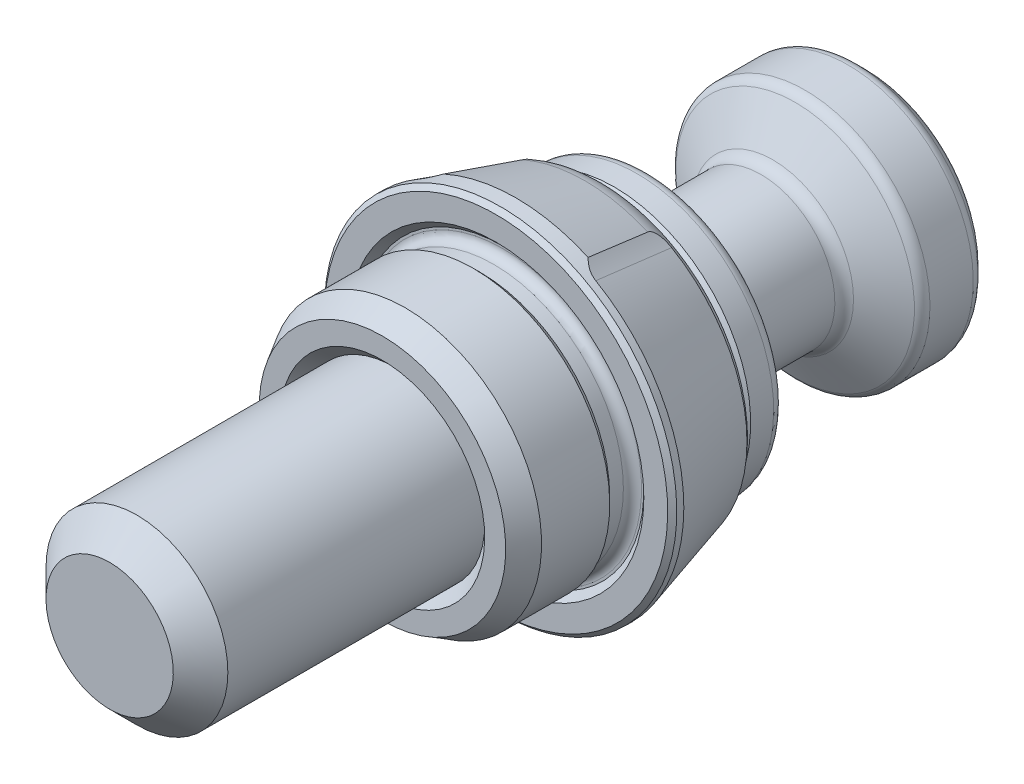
ISO-10303-21;
HEADER;
FILE_DESCRIPTION(('STEP AP214'),'2;1');
FILE_NAME('part.step','',(''),(''),'','','');
FILE_SCHEMA(('AUTOMOTIVE_DESIGN { 1 0 10303 214 1 1 1 1 }'));
ENDSEC;
DATA;
#1=APPLICATION_CONTEXT('core data for automotive mechanical design processes');
#2=APPLICATION_PROTOCOL_DEFINITION('international standard','automotive_design',2000,#1);
#3=PRODUCT_CONTEXT('',#1,'mechanical');
#4=PRODUCT('Part','Part','',(#3));
#5=PRODUCT_RELATED_PRODUCT_CATEGORY('part','',(#4));
#6=PRODUCT_DEFINITION_FORMATION('','',#4);
#7=PRODUCT_DEFINITION_CONTEXT('part definition',#1,'design');
#8=PRODUCT_DEFINITION('design','',#6,#7);
#9=PRODUCT_DEFINITION_SHAPE('','',#8);
#10=(LENGTH_UNIT() NAMED_UNIT(*) SI_UNIT(.MILLI.,.METRE.));
#11=(NAMED_UNIT(*) PLANE_ANGLE_UNIT() SI_UNIT($,.RADIAN.));
#12=(NAMED_UNIT(*) SI_UNIT($,.STERADIAN.) SOLID_ANGLE_UNIT());
#13=UNCERTAINTY_MEASURE_WITH_UNIT(LENGTH_MEASURE(1.E-05),#10,'distance_accuracy_value','');
#14=(GEOMETRIC_REPRESENTATION_CONTEXT(3) GLOBAL_UNCERTAINTY_ASSIGNED_CONTEXT((#13)) GLOBAL_UNIT_ASSIGNED_CONTEXT((#10,
#11,#12)) REPRESENTATION_CONTEXT('',''));
#15=CARTESIAN_POINT('',(0.,0.,0.));
#16=DIRECTION('',(0.,0.,1.));
#17=DIRECTION('',(1.,0.,0.));
#18=AXIS2_PLACEMENT_3D('',#15,#16,#17);
#19=CARTESIAN_POINT('',(-4.,0.,-5.));
#20=DIRECTION('',(0.,0.,1.));
#21=DIRECTION('',(0.,1.,0.));
#22=AXIS2_PLACEMENT_3D('',#19,#20,#21);
#23=PLANE('',#22);
#24=CARTESIAN_POINT('',(0.,0.,-5.));
#25=DIRECTION('',(0.,0.,1.));
#26=DIRECTION('',(0.,1.,0.));
#27=AXIS2_PLACEMENT_3D('',#24,#25,#26);
#28=CIRCLE('',#27,5.8);
#29=CARTESIAN_POINT('',(0.,5.8,-5.));
#30=VERTEX_POINT('',#29);
#31=EDGE_CURVE('E376',#30,#30,#28,.T.);
#32=ORIENTED_EDGE('',*,*,#31,.T.);
#33=EDGE_LOOP('',(#32));
#34=FACE_BOUND('',#33,.T.);
#35=CARTESIAN_POINT('',(0.,0.,-5.));
#36=DIRECTION('',(0.,0.,-1.));
#37=DIRECTION('',(0.,1.,0.));
#38=AXIS2_PLACEMENT_3D('',#35,#36,#37);
#39=CIRCLE('',#38,5.43594199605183);
#40=CARTESIAN_POINT('',(0.,5.43594199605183,-5.));
#41=VERTEX_POINT('',#40);
#42=EDGE_CURVE('E152',#41,#41,#39,.T.);
#43=ORIENTED_EDGE('',*,*,#42,.T.);
#44=EDGE_LOOP('',(#43));
#45=FACE_BOUND('',#44,.T.);
#46=ADVANCED_FACE('F14',(#34,#45),#23,.T.);
#47=CARTESIAN_POINT('',(0.,0.,-5.2));
#48=DIRECTION('',(0.,0.,-1.));
#49=DIRECTION('',(0.,-1.,0.));
#50=AXIS2_PLACEMENT_3D('',#47,#48,#49);
#51=CONICAL_SURFACE('',#50,6.,0.785398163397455);
#52=ORIENTED_EDGE('',*,*,#31,.F.);
#53=EDGE_LOOP('',(#52));
#54=FACE_BOUND('',#53,.T.);
#55=CARTESIAN_POINT('',(0.,0.,-5.2));
#56=DIRECTION('',(0.,0.,1.));
#57=DIRECTION('',(0.,1.,0.));
#58=AXIS2_PLACEMENT_3D('',#55,#56,#57);
#59=CIRCLE('',#58,6.);
#60=CARTESIAN_POINT('',(0.,6.,-5.2));
#61=VERTEX_POINT('',#60);
#62=EDGE_CURVE('E379',#61,#61,#59,.F.);
#63=ORIENTED_EDGE('',*,*,#62,.F.);
#64=EDGE_LOOP('',(#63));
#65=FACE_BOUND('',#64,.T.);
#66=ADVANCED_FACE('F288',(#54,#65),#51,.T.);
#67=CARTESIAN_POINT('',(0.,0.,-5.));
#68=DIRECTION('',(0.,0.,-1.));
#69=DIRECTION('',(0.,-1.,0.));
#70=AXIS2_PLACEMENT_3D('',#67,#68,#69);
#71=CYLINDRICAL_SURFACE('',#70,6.);
#72=CARTESIAN_POINT('',(0.,0.,-6.21132486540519));
#73=DIRECTION('',(0.,0.,-1.));
#74=DIRECTION('',(0.,-1.,0.));
#75=AXIS2_PLACEMENT_3D('',#72,#73,#74);
#76=CIRCLE('',#75,6.);
#77=CARTESIAN_POINT('',(0.,-6.,-6.21132486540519));
#78=VERTEX_POINT('',#77);
#79=EDGE_CURVE('E349',#78,#78,#76,.F.);
#80=ORIENTED_EDGE('',*,*,#79,.T.);
#81=EDGE_LOOP('',(#80));
#82=FACE_BOUND('',#81,.T.);
#83=ORIENTED_EDGE('',*,*,#62,.T.);
#84=EDGE_LOOP('',(#83));
#85=FACE_BOUND('',#84,.T.);
#86=ADVANCED_FACE('F284',(#82,#85),#71,.T.);
#87=CARTESIAN_POINT('',(0.,0.,-6.21132486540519));
#88=DIRECTION('',(0.,0.,-1.));
#89=DIRECTION('',(0.,-1.,0.));
#90=AXIS2_PLACEMENT_3D('',#87,#88,#89);
#91=TOROIDAL_SURFACE('',#90,5.5,0.5);
#92=CARTESIAN_POINT('',(0.,0.,-6.64433756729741));
#93=DIRECTION('',(0.,0.,-1.));
#94=DIRECTION('',(0.,-1.,0.));
#95=AXIS2_PLACEMENT_3D('',#92,#93,#94);
#96=CIRCLE('',#95,5.75);
#97=CARTESIAN_POINT('',(0.,-5.75,-6.64433756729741));
#98=VERTEX_POINT('',#97);
#99=EDGE_CURVE('E346',#98,#98,#96,.T.);
#100=ORIENTED_EDGE('',*,*,#99,.F.);
#101=EDGE_LOOP('',(#100));
#102=FACE_BOUND('',#101,.T.);
#103=ORIENTED_EDGE('',*,*,#79,.F.);
#104=EDGE_LOOP('',(#103));
#105=FACE_BOUND('',#104,.T.);
#106=ADVANCED_FACE('F287',(#102,#105),#91,.T.);
#107=CARTESIAN_POINT('',(0.,0.,-6.5));
#108=DIRECTION('',(0.,0.,1.));
#109=DIRECTION('',(0.,1.,0.));
#110=AXIS2_PLACEMENT_3D('',#107,#108,#109);
#111=CONICAL_SURFACE('',#110,6.,1.0471975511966);
#112=ORIENTED_EDGE('',*,*,#99,.T.);
#113=EDGE_LOOP('',(#112));
#114=FACE_BOUND('',#113,.T.);
#115=CARTESIAN_POINT('',(0.,0.,-7.91450815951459));
#116=DIRECTION('',(0.,0.,1.));
#117=DIRECTION('',(0.,1.,0.));
#118=AXIS2_PLACEMENT_3D('',#115,#116,#117);
#119=CIRCLE('',#118,3.55);
#120=CARTESIAN_POINT('',(0.,3.55,-7.91450815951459));
#121=VERTEX_POINT('',#120);
#122=EDGE_CURVE('E364',#121,#121,#119,.T.);
#123=ORIENTED_EDGE('',*,*,#122,.T.);
#124=EDGE_LOOP('',(#123));
#125=FACE_BOUND('',#124,.T.);
#126=ADVANCED_FACE('F278',(#114,#125),#111,.T.);
#127=CARTESIAN_POINT('',(0.,0.,-8.43412340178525));
#128=DIRECTION('',(0.,0.,1.));
#129=DIRECTION('',(0.,1.,0.));
#130=AXIS2_PLACEMENT_3D('',#127,#128,#129);
#131=TOROIDAL_SURFACE('',#130,3.85,0.6);
#132=CARTESIAN_POINT('',(0.,0.,-8.43412340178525));
#133=DIRECTION('',(0.,0.,1.));
#134=DIRECTION('',(0.,1.,0.));
#135=AXIS2_PLACEMENT_3D('',#132,#133,#134);
#136=CIRCLE('',#135,3.25);
#137=CARTESIAN_POINT('',(0.,3.25,-8.43412340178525));
#138=VERTEX_POINT('',#137);
#139=EDGE_CURVE('E373',#138,#138,#136,.F.);
#140=ORIENTED_EDGE('',*,*,#139,.F.);
#141=EDGE_LOOP('',(#140));
#142=FACE_BOUND('',#141,.T.);
#143=ORIENTED_EDGE('',*,*,#122,.F.);
#144=EDGE_LOOP('',(#143));
#145=FACE_BOUND('',#144,.T.);
#146=ADVANCED_FACE('F306',(#142,#145),#131,.F.);
#147=CARTESIAN_POINT('',(0.,0.,-5.));
#148=DIRECTION('',(0.,0.,1.));
#149=DIRECTION('',(0.,1.,0.));
#150=AXIS2_PLACEMENT_3D('',#147,#148,#149);
#151=CYLINDRICAL_SURFACE('',#150,3.25);
#152=CARTESIAN_POINT('',(0.,0.,-11.6535898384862));
#153=DIRECTION('',(0.,0.,1.));
#154=DIRECTION('',(0.,1.,0.));
#155=AXIS2_PLACEMENT_3D('',#152,#153,#154);
#156=CIRCLE('',#155,3.25);
#157=CARTESIAN_POINT('',(0.,3.25,-11.6535898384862));
#158=VERTEX_POINT('',#157);
#159=EDGE_CURVE('E370',#158,#158,#156,.T.);
#160=ORIENTED_EDGE('',*,*,#159,.T.);
#161=EDGE_LOOP('',(#160));
#162=FACE_BOUND('',#161,.T.);
#163=ORIENTED_EDGE('',*,*,#139,.T.);
#164=EDGE_LOOP('',(#163));
#165=FACE_BOUND('',#164,.T.);
#166=ADVANCED_FACE('F304',(#162,#165),#151,.T.);
#167=CARTESIAN_POINT('',(0.,0.,-11.6535898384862));
#168=DIRECTION('',(0.,0.,1.));
#169=DIRECTION('',(0.,1.,0.));
#170=AXIS2_PLACEMENT_3D('',#167,#168,#169);
#171=TOROIDAL_SURFACE('',#170,3.85,0.6);
#172=CARTESIAN_POINT('',(0.,0.,-12.1732050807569));
#173=DIRECTION('',(0.,0.,-1.));
#174=DIRECTION('',(0.,-1.,0.));
#175=AXIS2_PLACEMENT_3D('',#172,#173,#174);
#176=CIRCLE('',#175,3.55);
#177=CARTESIAN_POINT('',(0.,-3.55,-12.1732050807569));
#178=VERTEX_POINT('',#177);
#179=EDGE_CURVE('E367',#178,#178,#176,.T.);
#180=ORIENTED_EDGE('',*,*,#179,.F.);
#181=EDGE_LOOP('',(#180));
#182=FACE_BOUND('',#181,.T.);
#183=ORIENTED_EDGE('',*,*,#159,.F.);
#184=EDGE_LOOP('',(#183));
#185=FACE_BOUND('',#184,.T.);
#186=ADVANCED_FACE('F301',(#182,#185),#171,.F.);
#187=CARTESIAN_POINT('',(0.,0.,-12.));
#188=DIRECTION('',(0.,0.,-1.));
#189=DIRECTION('',(0.,-1.,0.));
#190=AXIS2_PLACEMENT_3D('',#187,#188,#189);
#191=CONICAL_SURFACE('',#190,3.25,1.0471975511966);
#192=CARTESIAN_POINT('',(0.,0.,-13.1547005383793));
#193=DIRECTION('',(0.,0.,1.));
#194=DIRECTION('',(0.,1.,0.));
#195=AXIS2_PLACEMENT_3D('',#192,#193,#194);
#196=CIRCLE('',#195,5.25);
#197=CARTESIAN_POINT('',(0.,5.25,-13.1547005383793));
#198=VERTEX_POINT('',#197);
#199=EDGE_CURVE('E352',#198,#198,#196,.T.);
#200=ORIENTED_EDGE('',*,*,#199,.T.);
#201=EDGE_LOOP('',(#200));
#202=FACE_BOUND('',#201,.T.);
#203=ORIENTED_EDGE('',*,*,#179,.T.);
#204=EDGE_LOOP('',(#203));
#205=FACE_BOUND('',#204,.T.);
#206=ADVANCED_FACE('F300',(#202,#205),#191,.T.);
#207=CARTESIAN_POINT('',(0.,0.,-13.5877132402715));
#208=DIRECTION('',(0.,0.,-1.));
#209=DIRECTION('',(0.,-1.,0.));
#210=AXIS2_PLACEMENT_3D('',#207,#208,#209);
#211=TOROIDAL_SURFACE('',#210,5.,0.5);
#212=CARTESIAN_POINT('',(0.,0.,-13.5877132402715));
#213=DIRECTION('',(0.,0.,-1.));
#214=DIRECTION('',(0.,-1.,0.));
#215=AXIS2_PLACEMENT_3D('',#212,#213,#214);
#216=CIRCLE('',#215,5.5);
#217=CARTESIAN_POINT('',(0.,-5.5,-13.5877132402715));
#218=VERTEX_POINT('',#217);
#219=EDGE_CURVE('E361',#218,#218,#216,.T.);
#220=ORIENTED_EDGE('',*,*,#219,.F.);
#221=EDGE_LOOP('',(#220));
#222=FACE_BOUND('',#221,.T.);
#223=ORIENTED_EDGE('',*,*,#199,.F.);
#224=EDGE_LOOP('',(#223));
#225=FACE_BOUND('',#224,.T.);
#226=ADVANCED_FACE('F314',(#222,#225),#211,.T.);
#227=CARTESIAN_POINT('',(0.,0.,-5.));
#228=DIRECTION('',(0.,0.,1.));
#229=DIRECTION('',(0.,1.,0.));
#230=AXIS2_PLACEMENT_3D('',#227,#228,#229);
#231=CYLINDRICAL_SURFACE('',#230,5.5);
#232=CARTESIAN_POINT('',(0.,0.,-15.4928932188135));
#233=DIRECTION('',(0.,0.,-1.));
#234=DIRECTION('',(0.,-1.,0.));
#235=AXIS2_PLACEMENT_3D('',#232,#233,#234);
#236=CIRCLE('',#235,5.5);
#237=CARTESIAN_POINT('',(0.,-5.5,-15.4928932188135));
#238=VERTEX_POINT('',#237);
#239=EDGE_CURVE('E358',#238,#238,#236,.F.);
#240=ORIENTED_EDGE('',*,*,#239,.T.);
#241=EDGE_LOOP('',(#240));
#242=FACE_BOUND('',#241,.T.);
#243=ORIENTED_EDGE('',*,*,#219,.T.);
#244=EDGE_LOOP('',(#243));
#245=FACE_BOUND('',#244,.T.);
#246=ADVANCED_FACE('F283',(#242,#245),#231,.T.);
#247=CARTESIAN_POINT('',(0.,0.,-15.4928932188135));
#248=DIRECTION('',(0.,0.,-1.));
#249=DIRECTION('',(0.,-1.,0.));
#250=AXIS2_PLACEMENT_3D('',#247,#248,#249);
#251=TOROIDAL_SURFACE('',#250,5.,0.5);
#252=CARTESIAN_POINT('',(0.,0.,-15.8464466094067));
#253=DIRECTION('',(0.,0.,-1.));
#254=DIRECTION('',(0.,-1.,0.));
#255=AXIS2_PLACEMENT_3D('',#252,#253,#254);
#256=CIRCLE('',#255,5.35355339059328);
#257=CARTESIAN_POINT('',(0.,-5.35355339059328,-15.8464466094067));
#258=VERTEX_POINT('',#257);
#259=EDGE_CURVE('E355',#258,#258,#256,.T.);
#260=ORIENTED_EDGE('',*,*,#259,.F.);
#261=EDGE_LOOP('',(#260));
#262=FACE_BOUND('',#261,.T.);
#263=ORIENTED_EDGE('',*,*,#239,.F.);
#264=EDGE_LOOP('',(#263));
#265=FACE_BOUND('',#264,.T.);
#266=ADVANCED_FACE('F310',(#262,#265),#251,.T.);
#267=CARTESIAN_POINT('',(0.,0.,-15.7));
#268=DIRECTION('',(0.,0.,1.));
#269=DIRECTION('',(0.,1.,0.));
#270=AXIS2_PLACEMENT_3D('',#267,#268,#269);
#271=CONICAL_SURFACE('',#270,5.5,0.785398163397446);
#272=CARTESIAN_POINT('',(0.,0.,-16.2071067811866));
#273=DIRECTION('',(0.,0.,-1.));
#274=DIRECTION('',(0.,-1.,0.));
#275=AXIS2_PLACEMENT_3D('',#272,#273,#274);
#276=CIRCLE('',#275,4.99289321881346);
#277=CARTESIAN_POINT('',(0.,-4.99289321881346,-16.2071067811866));
#278=VERTEX_POINT('',#277);
#279=EDGE_CURVE('E339',#278,#278,#276,.F.);
#280=ORIENTED_EDGE('',*,*,#279,.T.);
#281=EDGE_LOOP('',(#280));
#282=FACE_BOUND('',#281,.T.);
#283=ORIENTED_EDGE('',*,*,#259,.T.);
#284=EDGE_LOOP('',(#283));
#285=FACE_BOUND('',#284,.T.);
#286=ADVANCED_FACE('F209',(#282,#285),#271,.T.);
#287=CARTESIAN_POINT('',(0.,0.,-15.5));
#288=DIRECTION('',(0.,0.,-1.));
#289=DIRECTION('',(0.,-1.,0.));
#290=AXIS2_PLACEMENT_3D('',#287,#288,#289);
#291=TOROIDAL_SURFACE('',#290,4.28578643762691,1.);
#292=CARTESIAN_POINT('',(0.,0.,-16.5));
#293=DIRECTION('',(0.,0.,-1.));
#294=DIRECTION('',(0.,-1.,0.));
#295=AXIS2_PLACEMENT_3D('',#292,#293,#294);
#296=CIRCLE('',#295,4.28578643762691);
#297=CARTESIAN_POINT('',(0.,-4.28578643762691,-16.5));
#298=VERTEX_POINT('',#297);
#299=EDGE_CURVE('E18',#298,#298,#296,.T.);
#300=ORIENTED_EDGE('',*,*,#299,.F.);
#301=EDGE_LOOP('',(#300));
#302=FACE_BOUND('',#301,.T.);
#303=ORIENTED_EDGE('',*,*,#279,.F.);
#304=EDGE_LOOP('',(#303));
#305=FACE_BOUND('',#304,.T.);
#306=ADVANCED_FACE('F16',(#302,#305),#291,.T.);
#307=CARTESIAN_POINT('',(-6.,0.,-16.5));
#308=DIRECTION('',(0.,0.,-1.));
#309=DIRECTION('',(0.,-1.,0.));
#310=AXIS2_PLACEMENT_3D('',#307,#308,#309);
#311=PLANE('',#310);
#312=ORIENTED_EDGE('',*,*,#299,.T.);
#313=EDGE_LOOP('',(#312));
#314=FACE_BOUND('',#313,.T.);
#315=CARTESIAN_POINT('',(0.,0.,-16.5));
#316=DIRECTION('',(0.,0.,1.));
#317=DIRECTION('',(0.,1.,0.));
#318=AXIS2_PLACEMENT_3D('',#315,#316,#317);
#319=CIRCLE('',#318,2.);
#320=CARTESIAN_POINT('',(0.,2.,-16.5));
#321=VERTEX_POINT('',#320);
#322=EDGE_CURVE('E177',#321,#321,#319,.T.);
#323=ORIENTED_EDGE('',*,*,#322,.T.);
#324=EDGE_LOOP('',(#323));
#325=FACE_BOUND('',#324,.T.);
#326=ADVANCED_FACE('F205',(#314,#325),#311,.T.);
#327=CARTESIAN_POINT('',(0.,0.,-16.5));
#328=DIRECTION('',(0.,0.,-1.));
#329=DIRECTION('',(0.,-1.,0.));
#330=AXIS2_PLACEMENT_3D('',#327,#328,#329);
#331=CONICAL_SURFACE('',#330,2.,1.0471975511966);
#332=ORIENTED_EDGE('',*,*,#322,.F.);
#333=EDGE_LOOP('',(#332));
#334=FACE_BOUND('',#333,.T.);
#335=CARTESIAN_POINT('',(-0.8659099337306,1.5002,-16.3453661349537));
#336=CARTESIAN_POINT('',(-0.903968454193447,1.43428070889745,-16.3233823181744));
#337=CARTESIAN_POINT('',(-0.942355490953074,1.36779241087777,-16.303388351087));
#338=CARTESIAN_POINT('',(-1.01979436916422,1.23366433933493,-16.2684875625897));
#339=CARTESIAN_POINT('',(-1.05884758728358,1.16602218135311,-16.2535930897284));
#340=CARTESIAN_POINT('',(-1.13646999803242,1.03157622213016,-16.2304061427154));
#341=CARTESIAN_POINT('',(-1.17502724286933,0.964793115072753,-16.221959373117));
#342=CARTESIAN_POINT('',(-1.25232329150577,0.830912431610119,-16.211873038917));
#343=CARTESIAN_POINT('',(-1.29106181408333,0.763815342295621,-16.2102251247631));
#344=CARTESIAN_POINT('',(-1.363455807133,0.638425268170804,-16.2136410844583));
#345=CARTESIAN_POINT('',(-1.39712207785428,0.580113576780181,-16.2178662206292));
#346=CARTESIAN_POINT('',(-1.46423526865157,0.463870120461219,-16.2312612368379));
#347=CARTESIAN_POINT('',(-1.49768195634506,0.405938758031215,-16.240435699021));
#348=CARTESIAN_POINT('',(-1.56493368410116,0.289455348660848,-16.2633726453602));
#349=CARTESIAN_POINT('',(-1.59873020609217,0.230918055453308,-16.2772324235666));
#350=CARTESIAN_POINT('',(-1.6658189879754,0.114716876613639,-16.3086892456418));
#351=CARTESIAN_POINT('',(-1.699112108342,0.0570515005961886,-16.3262788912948));
#352=CARTESIAN_POINT('',(-1.73216627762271,-0.000200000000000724,-16.3453661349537));
#353=B_SPLINE_CURVE_WITH_KNOTS('',3,(#335,#336,#337,#338,#339,#340,#341,#342,#343,#344,#345,
#346,#347,#348,#349,#350,#351,#352),.UNSPECIFIED.,.F.,.F.,(4,2,2,2,2,2,2,2,4),(0.,
0.237777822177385,0.476127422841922,0.708577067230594,0.940741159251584,1.14294352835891,
1.34533342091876,1.55221450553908,1.75868901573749),.UNSPECIFIED.);
#354=CARTESIAN_POINT('',(-0.866025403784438,1.5,-16.3452994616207));
#355=VERTEX_POINT('',#354);
#356=CARTESIAN_POINT('',(-1.73205080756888,0.,-16.3452994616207));
#357=VERTEX_POINT('',#356);
#358=EDGE_CURVE('E79',#355,#357,#353,.T.);
#359=ORIENTED_EDGE('',*,*,#358,.T.);
#360=CARTESIAN_POINT('',(-1.73216627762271,0.000199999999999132,-16.3453661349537));
#361=CARTESIAN_POINT('',(-1.69410775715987,-0.0657192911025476,-16.3233823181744));
#362=CARTESIAN_POINT('',(-1.65572072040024,-0.132207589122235,-16.303388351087));
#363=CARTESIAN_POINT('',(-1.5782818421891,-0.266335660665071,-16.2684875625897));
#364=CARTESIAN_POINT('',(-1.53922862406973,-0.333977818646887,-16.2535930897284));
#365=CARTESIAN_POINT('',(-1.4616062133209,-0.468423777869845,-16.2304061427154));
#366=CARTESIAN_POINT('',(-1.42304896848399,-0.53520688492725,-16.221959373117));
#367=CARTESIAN_POINT('',(-1.34575291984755,-0.669087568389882,-16.211873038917));
#368=CARTESIAN_POINT('',(-1.30701439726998,-0.73618465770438,-16.2102251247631));
#369=CARTESIAN_POINT('',(-1.23462040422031,-0.861574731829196,-16.2136410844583));
#370=CARTESIAN_POINT('',(-1.20095413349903,-0.91988642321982,-16.2178662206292));
#371=CARTESIAN_POINT('',(-1.13384094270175,-1.03612987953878,-16.2312612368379));
#372=CARTESIAN_POINT('',(-1.10039425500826,-1.09406124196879,-16.240435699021));
#373=CARTESIAN_POINT('',(-1.03314252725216,-1.21054465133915,-16.2633726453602));
#374=CARTESIAN_POINT('',(-0.999346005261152,-1.26908194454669,-16.2772324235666));
#375=CARTESIAN_POINT('',(-0.932257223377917,-1.38528312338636,-16.3086892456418));
#376=CARTESIAN_POINT('',(-0.898964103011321,-1.44294849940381,-16.3262788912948));
#377=CARTESIAN_POINT('',(-0.865909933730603,-1.5002,-16.3453661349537));
#378=B_SPLINE_CURVE_WITH_KNOTS('',3,(#360,#361,#362,#363,#364,#365,#366,#367,#368,#369,#370,
#371,#372,#373,#374,#375,#376,#377),.UNSPECIFIED.,.F.,.F.,(4,2,2,2,2,2,2,2,4),(0.,
0.237777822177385,0.476127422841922,0.708577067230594,0.940741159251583,1.14294352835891,
1.34533342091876,1.55221450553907,1.75868901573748),.UNSPECIFIED.);
#379=CARTESIAN_POINT('',(-0.86602540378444,-1.5,-16.3452994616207));
#380=VERTEX_POINT('',#379);
#381=EDGE_CURVE('E180',#357,#380,#378,.T.);
#382=ORIENTED_EDGE('',*,*,#381,.T.);
#383=CARTESIAN_POINT('',(2.29543900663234,-1.5,-16.9284440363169));
#384=CARTESIAN_POINT('',(2.23016907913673,-1.5,-16.8969074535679));
#385=CARTESIAN_POINT('',(2.16474594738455,-1.5,-16.8656823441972));
#386=CARTESIAN_POINT('',(2.03351166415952,-1.5,-16.8040309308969));
#387=CARTESIAN_POINT('',(1.96770045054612,-1.5,-16.773604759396));
#388=CARTESIAN_POINT('',(1.83525433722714,-1.5,-16.7135673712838));
#389=CARTESIAN_POINT('',(1.76861688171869,-1.5,-16.6839617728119));
#390=CARTESIAN_POINT('',(1.63480095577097,-1.5,-16.6260043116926));
#391=CARTESIAN_POINT('',(1.56762251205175,-1.5,-16.5976523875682));
#392=CARTESIAN_POINT('',(1.43058681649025,-1.5,-16.5417052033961));
#393=CARTESIAN_POINT('',(1.36070972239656,-1.5,-16.5141582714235));
#394=CARTESIAN_POINT('',(1.22012618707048,-1.5,-16.4612246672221));
#395=CARTESIAN_POINT('',(1.14941964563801,-1.5,-16.4358382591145));
#396=CARTESIAN_POINT('',(1.00721111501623,-1.5,-16.3879160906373));
#397=CARTESIAN_POINT('',(0.935711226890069,-1.5,-16.3653741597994));
#398=CARTESIAN_POINT('',(0.79168072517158,-1.5,-16.3238812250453));
#399=CARTESIAN_POINT('',(0.71915036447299,-1.5,-16.3049293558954));
#400=CARTESIAN_POINT('',(0.573415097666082,-1.5,-16.2716463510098));
#401=CARTESIAN_POINT('',(0.50021567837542,-1.5,-16.2572916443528));
#402=CARTESIAN_POINT('',(0.352940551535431,-1.5,-16.234036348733));
#403=CARTESIAN_POINT('',(0.278864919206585,-1.5,-16.2251352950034));
#404=CARTESIAN_POINT('',(0.131159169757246,-1.5,-16.2136168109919));
#405=CARTESIAN_POINT('',(0.0575353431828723,-1.5,-16.2109210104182));
#406=CARTESIAN_POINT('',(-0.0896707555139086,-1.5,-16.2118280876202));
#407=CARTESIAN_POINT('',(-0.163253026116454,-1.5,-16.2154311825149));
#408=CARTESIAN_POINT('',(-0.341649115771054,-1.5,-16.2314857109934));
#409=CARTESIAN_POINT('',(-0.446180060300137,-1.5,-16.2470947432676));
#410=CARTESIAN_POINT('',(-0.653280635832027,-1.5,-16.2882095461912));
#411=CARTESIAN_POINT('',(-0.755848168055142,-1.5,-16.3137253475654));
#412=CARTESIAN_POINT('',(-0.961126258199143,-1.5,-16.3725352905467));
#413=CARTESIAN_POINT('',(-1.06378994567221,-1.5,-16.4059887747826));
#414=CARTESIAN_POINT('',(-1.26721758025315,-1.5,-16.4780546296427));
#415=CARTESIAN_POINT('',(-1.36798209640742,-1.5,-16.516665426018));
#416=CARTESIAN_POINT('',(-1.60568963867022,-1.5,-16.6126473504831));
#417=CARTESIAN_POINT('',(-1.74198279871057,-1.5,-16.671611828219));
#418=CARTESIAN_POINT('',(-2.0126915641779,-1.5,-16.7937291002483));
#419=CARTESIAN_POINT('',(-2.1471066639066,-1.5,-16.8568829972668));
#420=CARTESIAN_POINT('',(-2.41474388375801,-1.5,-16.9859892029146));
#421=CARTESIAN_POINT('',(-2.54796469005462,-1.5,-17.0519442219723));
#422=CARTESIAN_POINT('',(-2.81346836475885,-1.5,-17.1857175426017));
#423=CARTESIAN_POINT('',(-2.94575120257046,-1.5,-17.253535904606));
#424=CARTESIAN_POINT('',(-3.19854913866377,-1.5,-17.3847374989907));
#425=CARTESIAN_POINT('',(-3.31911936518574,-1.5,-17.4480147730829));
#426=CARTESIAN_POINT('',(-3.55982498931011,-1.5,-17.5753998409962));
#427=CARTESIAN_POINT('',(-3.67996037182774,-1.5,-17.6395076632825));
#428=CARTESIAN_POINT('',(-3.9196048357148,-1.5,-17.7682016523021));
#429=CARTESIAN_POINT('',(-4.03911472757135,-1.5,-17.8327863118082));
#430=CARTESIAN_POINT('',(-4.2778570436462,-1.5,-17.9624516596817));
#431=CARTESIAN_POINT('',(-4.39708948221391,-1.5,-18.0275323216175));
#432=CARTESIAN_POINT('',(-4.51621992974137,-1.5,-18.0927978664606));
#433=B_SPLINE_CURVE_WITH_KNOTS('',3,(#383,#384,#385,#386,#387,#388,#389,#390,#391,#392,#393,
#394,#395,#396,#397,#398,#399,#400,#401,#402,#403,#404,#405,#406,#407,#408,#409,#410,#411,#412,
#413,#414,#415,#416,#417,#418,#419,#420,#421,#422,#423,#424,#425,#426,#427,#428,#429,#430,#431,
#432),.UNSPECIFIED.,.F.,.F.,(4,2,2,2,2,2,2,2,2,2,2,2,2,2,2,2,2,2,2,2,2,2,2,2,4),(0.,
0.217471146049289,0.434978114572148,0.653721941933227,0.872455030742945,1.09776002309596,
1.32309251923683,1.54792748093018,1.77270818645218,1.99631720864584,2.21990717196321,
2.440657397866,2.66141523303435,2.97783093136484,3.29456784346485,3.61830004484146,
3.94193365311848,4.38731314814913,4.8328103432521,5.27874889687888,5.72470193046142,
6.13319601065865,6.54170412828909,6.94923706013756,7.35674842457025),.UNSPECIFIED.);
#434=CARTESIAN_POINT('',(0.866025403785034,-1.5,-16.3452994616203));
#435=VERTEX_POINT('',#434);
#436=EDGE_CURVE('E188',#380,#435,#433,.F.);
#437=ORIENTED_EDGE('',*,*,#436,.T.);
#438=CARTESIAN_POINT('',(0.865909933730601,-1.5002,-16.3453661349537));
#439=CARTESIAN_POINT('',(0.903968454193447,-1.43428070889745,-16.3233823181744));
#440=CARTESIAN_POINT('',(0.942355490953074,-1.36779241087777,-16.303388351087));
#441=CARTESIAN_POINT('',(1.01979436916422,-1.23366433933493,-16.2684875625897));
#442=CARTESIAN_POINT('',(1.05884758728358,-1.16602218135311,-16.2535930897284));
#443=CARTESIAN_POINT('',(1.13646999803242,-1.03157622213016,-16.2304061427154));
#444=CARTESIAN_POINT('',(1.17502724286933,-0.964793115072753,-16.221959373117));
#445=CARTESIAN_POINT('',(1.25232329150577,-0.83091243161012,-16.211873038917));
#446=CARTESIAN_POINT('',(1.29106181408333,-0.763815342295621,-16.2102251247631));
#447=CARTESIAN_POINT('',(1.363455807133,-0.638425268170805,-16.2136410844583));
#448=CARTESIAN_POINT('',(1.39712207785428,-0.580113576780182,-16.2178662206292));
#449=CARTESIAN_POINT('',(1.46423526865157,-0.46387012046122,-16.2312612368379));
#450=CARTESIAN_POINT('',(1.49768195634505,-0.405938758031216,-16.240435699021));
#451=CARTESIAN_POINT('',(1.56493368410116,-0.289455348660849,-16.2633726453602));
#452=CARTESIAN_POINT('',(1.59873020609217,-0.230918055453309,-16.2772324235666));
#453=CARTESIAN_POINT('',(1.6658189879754,-0.114716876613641,-16.3086892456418));
#454=CARTESIAN_POINT('',(1.699112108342,-0.0570515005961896,-16.3262788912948));
#455=CARTESIAN_POINT('',(1.73216627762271,0.000200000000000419,-16.3453661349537));
#456=B_SPLINE_CURVE_WITH_KNOTS('',3,(#438,#439,#440,#441,#442,#443,#444,#445,#446,#447,#448,
#449,#450,#451,#452,#453,#454,#455),.UNSPECIFIED.,.F.,.F.,(4,2,2,2,2,2,2,2,4),(0.,
0.237777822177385,0.476127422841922,0.708577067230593,0.940741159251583,1.14294352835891,
1.34533342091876,1.55221450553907,1.75868901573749),.UNSPECIFIED.);
#457=CARTESIAN_POINT('',(1.73205080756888,0.,-16.3452994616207));
#458=VERTEX_POINT('',#457);
#459=EDGE_CURVE('E217',#435,#458,#456,.T.);
#460=ORIENTED_EDGE('',*,*,#459,.T.);
#461=CARTESIAN_POINT('',(1.73216627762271,-0.000199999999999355,-16.3453661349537));
#462=CARTESIAN_POINT('',(1.69410775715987,0.0657192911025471,-16.3233823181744));
#463=CARTESIAN_POINT('',(1.65572072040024,0.132207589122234,-16.303388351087));
#464=CARTESIAN_POINT('',(1.5782818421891,0.26633566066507,-16.2684875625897));
#465=CARTESIAN_POINT('',(1.53922862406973,0.333977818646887,-16.2535930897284));
#466=CARTESIAN_POINT('',(1.4616062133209,0.468423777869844,-16.2304061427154));
#467=CARTESIAN_POINT('',(1.42304896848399,0.535206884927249,-16.221959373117));
#468=CARTESIAN_POINT('',(1.34575291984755,0.669087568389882,-16.211873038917));
#469=CARTESIAN_POINT('',(1.30701439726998,0.73618465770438,-16.2102251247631));
#470=CARTESIAN_POINT('',(1.23462040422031,0.861574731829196,-16.2136410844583));
#471=CARTESIAN_POINT('',(1.20095413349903,0.91988642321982,-16.2178662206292));
#472=CARTESIAN_POINT('',(1.13384094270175,1.03612987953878,-16.2312612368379));
#473=CARTESIAN_POINT('',(1.10039425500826,1.09406124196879,-16.240435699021));
#474=CARTESIAN_POINT('',(1.03314252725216,1.21054465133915,-16.2633726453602));
#475=CARTESIAN_POINT('',(0.99934600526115,1.26908194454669,-16.2772324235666));
#476=CARTESIAN_POINT('',(0.932257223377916,1.38528312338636,-16.3086892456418));
#477=CARTESIAN_POINT('',(0.89896410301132,1.44294849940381,-16.3262788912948));
#478=CARTESIAN_POINT('',(0.865909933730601,1.5002,-16.3453661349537));
#479=B_SPLINE_CURVE_WITH_KNOTS('',3,(#461,#462,#463,#464,#465,#466,#467,#468,#469,#470,#471,
#472,#473,#474,#475,#476,#477,#478),.UNSPECIFIED.,.F.,.F.,(4,2,2,2,2,2,2,2,4),(0.,
0.237777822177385,0.476127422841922,0.708577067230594,0.940741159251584,1.14294352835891,
1.34533342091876,1.55221450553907,1.75868901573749),.UNSPECIFIED.);
#480=CARTESIAN_POINT('',(0.866025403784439,1.5,-16.3452994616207));
#481=VERTEX_POINT('',#480);
#482=EDGE_CURVE('E224',#458,#481,#479,.T.);
#483=ORIENTED_EDGE('',*,*,#482,.T.);
#484=CARTESIAN_POINT('',(2.29543900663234,1.5,-16.9284440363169));
#485=CARTESIAN_POINT('',(2.23016907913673,1.5,-16.8969074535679));
#486=CARTESIAN_POINT('',(2.16474594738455,1.5,-16.8656823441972));
#487=CARTESIAN_POINT('',(2.03351166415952,1.5,-16.8040309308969));
#488=CARTESIAN_POINT('',(1.96770045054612,1.5,-16.773604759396));
#489=CARTESIAN_POINT('',(1.83525433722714,1.5,-16.7135673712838));
#490=CARTESIAN_POINT('',(1.76861688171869,1.5,-16.6839617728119));
#491=CARTESIAN_POINT('',(1.63480095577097,1.5,-16.6260043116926));
#492=CARTESIAN_POINT('',(1.56762251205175,1.5,-16.5976523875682));
#493=CARTESIAN_POINT('',(1.43058681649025,1.5,-16.5417052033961));
#494=CARTESIAN_POINT('',(1.36070972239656,1.5,-16.5141582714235));
#495=CARTESIAN_POINT('',(1.22012618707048,1.5,-16.4612246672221));
#496=CARTESIAN_POINT('',(1.14941964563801,1.5,-16.4358382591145));
#497=CARTESIAN_POINT('',(1.00721111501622,1.5,-16.3879160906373));
#498=CARTESIAN_POINT('',(0.935711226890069,1.5,-16.3653741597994));
#499=CARTESIAN_POINT('',(0.791680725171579,1.5,-16.3238812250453));
#500=CARTESIAN_POINT('',(0.71915036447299,1.5,-16.3049293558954));
#501=CARTESIAN_POINT('',(0.573415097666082,1.5,-16.2716463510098));
#502=CARTESIAN_POINT('',(0.500215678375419,1.5,-16.2572916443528));
#503=CARTESIAN_POINT('',(0.352940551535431,1.5,-16.234036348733));
#504=CARTESIAN_POINT('',(0.278864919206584,1.5,-16.2251352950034));
#505=CARTESIAN_POINT('',(0.131159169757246,1.5,-16.2136168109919));
#506=CARTESIAN_POINT('',(0.0575353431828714,1.5,-16.2109210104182));
#507=CARTESIAN_POINT('',(-0.0896707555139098,1.5,-16.2118280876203));
#508=CARTESIAN_POINT('',(-0.163253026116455,1.5,-16.2154311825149));
#509=CARTESIAN_POINT('',(-0.341649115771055,1.5,-16.2314857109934));
#510=CARTESIAN_POINT('',(-0.446180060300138,1.5,-16.2470947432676));
#511=CARTESIAN_POINT('',(-0.653280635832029,1.5,-16.2882095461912));
#512=CARTESIAN_POINT('',(-0.755848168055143,1.5,-16.3137253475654));
#513=CARTESIAN_POINT('',(-0.961126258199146,1.5,-16.3725352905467));
#514=CARTESIAN_POINT('',(-1.06378994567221,1.5,-16.4059887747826));
#515=CARTESIAN_POINT('',(-1.26721758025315,1.5,-16.4780546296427));
#516=CARTESIAN_POINT('',(-1.36798209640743,1.5,-16.516665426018));
#517=CARTESIAN_POINT('',(-1.60568963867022,1.5,-16.6126473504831));
#518=CARTESIAN_POINT('',(-1.74198279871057,1.5,-16.671611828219));
#519=CARTESIAN_POINT('',(-2.0126915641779,1.5,-16.7937291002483));
#520=CARTESIAN_POINT('',(-2.14710666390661,1.5,-16.8568829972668));
#521=CARTESIAN_POINT('',(-2.41474388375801,1.5,-16.9859892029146));
#522=CARTESIAN_POINT('',(-2.54796469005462,1.5,-17.0519442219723));
#523=CARTESIAN_POINT('',(-2.81346836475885,1.5,-17.1857175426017));
#524=CARTESIAN_POINT('',(-2.94575120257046,1.5,-17.253535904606));
#525=CARTESIAN_POINT('',(-3.19854913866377,1.5,-17.3847374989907));
#526=CARTESIAN_POINT('',(-3.31911936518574,1.5,-17.4480147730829));
#527=CARTESIAN_POINT('',(-3.55982498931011,1.5,-17.5753998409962));
#528=CARTESIAN_POINT('',(-3.67996037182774,1.5,-17.6395076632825));
#529=CARTESIAN_POINT('',(-3.91960483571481,1.5,-17.7682016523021));
#530=CARTESIAN_POINT('',(-4.03911472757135,1.5,-17.8327863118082));
#531=CARTESIAN_POINT('',(-4.2778570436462,1.5,-17.9624516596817));
#532=CARTESIAN_POINT('',(-4.39708948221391,1.5,-18.0275323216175));
#533=CARTESIAN_POINT('',(-4.51621992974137,1.5,-18.0927978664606));
#534=B_SPLINE_CURVE_WITH_KNOTS('',3,(#484,#485,#486,#487,#488,#489,#490,#491,#492,#493,#494,
#495,#496,#497,#498,#499,#500,#501,#502,#503,#504,#505,#506,#507,#508,#509,#510,#511,#512,#513,
#514,#515,#516,#517,#518,#519,#520,#521,#522,#523,#524,#525,#526,#527,#528,#529,#530,#531,#532,
#533),.UNSPECIFIED.,.F.,.F.,(4,2,2,2,2,2,2,2,2,2,2,2,2,2,2,2,2,2,2,2,2,2,2,2,4),(0.,
0.217471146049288,0.434978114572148,0.653721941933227,0.872455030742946,1.09776002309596,
1.32309251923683,1.54792748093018,1.77270818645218,1.99631720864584,2.21990717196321,
2.440657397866,2.66141523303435,2.97783093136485,3.29456784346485,3.61830004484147,
3.94193365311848,4.38731314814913,4.83281034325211,5.27874889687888,5.72470193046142,
6.13319601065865,6.5417041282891,6.94923706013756,7.35674842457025),.UNSPECIFIED.);
#535=EDGE_CURVE('E231',#481,#355,#534,.T.);
#536=ORIENTED_EDGE('',*,*,#535,.T.);
#537=EDGE_LOOP('',(#359,#382,#437,#460,#483,#536));
#538=FACE_BOUND('',#537,.T.);
#539=ADVANCED_FACE('F199',(#334,#538),#331,.F.);
#540=CARTESIAN_POINT('',(-1.73205080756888,0.,-14.));
#541=DIRECTION('',(-0.866025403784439,0.5,0.));
#542=DIRECTION('',(-0.5,-0.866025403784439,0.));
#543=AXIS2_PLACEMENT_3D('',#540,#541,#542);
#544=PLANE('',#543);
#545=ORIENTED_EDGE('',*,*,#358,.F.);
#546=DIRECTION('',(0.,0.,-1.));
#547=VECTOR('',#546,1.);
#548=CARTESIAN_POINT('',(-0.866025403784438,1.5,-14.));
#549=LINE('',#548,#547);
#550=CARTESIAN_POINT('',(-0.866025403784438,1.5,-14.));
#551=VERTEX_POINT('',#550);
#552=EDGE_CURVE('E386',#551,#355,#549,.T.);
#553=ORIENTED_EDGE('',*,*,#552,.F.);
#554=DIRECTION('',(0.5,0.866025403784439,0.));
#555=VECTOR('',#554,1.);
#556=CARTESIAN_POINT('',(-1.73205080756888,0.,-14.));
#557=LINE('',#556,#555);
#558=CARTESIAN_POINT('',(-1.73205080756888,0.,-14.));
#559=VERTEX_POINT('',#558);
#560=EDGE_CURVE('E407',#559,#551,#557,.T.);
#561=ORIENTED_EDGE('',*,*,#560,.F.);
#562=DIRECTION('',(0.,0.,-1.));
#563=VECTOR('',#562,1.);
#564=CARTESIAN_POINT('',(-1.73205080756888,0.,-14.));
#565=LINE('',#564,#563);
#566=EDGE_CURVE('E383',#559,#357,#565,.T.);
#567=ORIENTED_EDGE('',*,*,#566,.T.);
#568=EDGE_LOOP('',(#545,#553,#561,#567));
#569=FACE_BOUND('',#568,.T.);
#570=ADVANCED_FACE('F204',(#569),#544,.F.);
#571=CARTESIAN_POINT('',(-0.86602540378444,-1.5,-14.));
#572=DIRECTION('',(-0.866025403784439,-0.5,0.));
#573=DIRECTION('',(0.5,-0.866025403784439,0.));
#574=AXIS2_PLACEMENT_3D('',#571,#572,#573);
#575=PLANE('',#574);
#576=ORIENTED_EDGE('',*,*,#381,.F.);
#577=ORIENTED_EDGE('',*,*,#566,.F.);
#578=DIRECTION('',(-0.5,0.866025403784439,0.));
#579=VECTOR('',#578,1.);
#580=CARTESIAN_POINT('',(-0.86602540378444,-1.5,-14.));
#581=LINE('',#580,#579);
#582=CARTESIAN_POINT('',(-0.86602540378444,-1.5,-14.));
#583=VERTEX_POINT('',#582);
#584=EDGE_CURVE('E408',#583,#559,#581,.T.);
#585=ORIENTED_EDGE('',*,*,#584,.F.);
#586=DIRECTION('',(0.,0.,-1.));
#587=VECTOR('',#586,1.);
#588=CARTESIAN_POINT('',(-0.86602540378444,-1.5,-14.));
#589=LINE('',#588,#587);
#590=EDGE_CURVE('E382',#583,#380,#589,.T.);
#591=ORIENTED_EDGE('',*,*,#590,.T.);
#592=EDGE_LOOP('',(#576,#577,#585,#591));
#593=FACE_BOUND('',#592,.T.);
#594=ADVANCED_FACE('F195',(#593),#575,.F.);
#595=CARTESIAN_POINT('',(0.866025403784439,-1.5,-14.));
#596=DIRECTION('',(0.,-1.,0.));
#597=DIRECTION('',(1.,0.,0.));
#598=AXIS2_PLACEMENT_3D('',#595,#596,#597);
#599=PLANE('',#598);
#600=ORIENTED_EDGE('',*,*,#436,.F.);
#601=ORIENTED_EDGE('',*,*,#590,.F.);
#602=DIRECTION('',(-1.,0.,0.));
#603=VECTOR('',#602,1.);
#604=CARTESIAN_POINT('',(0.866025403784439,-1.5,-14.));
#605=LINE('',#604,#603);
#606=CARTESIAN_POINT('',(0.866025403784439,-1.5,-14.));
#607=VERTEX_POINT('',#606);
#608=EDGE_CURVE('E73',#607,#583,#605,.T.);
#609=ORIENTED_EDGE('',*,*,#608,.F.);
#610=DIRECTION('',(0.,0.,-1.));
#611=VECTOR('',#610,1.);
#612=CARTESIAN_POINT('',(0.866025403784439,-1.5,-14.));
#613=LINE('',#612,#611);
#614=EDGE_CURVE('E395',#607,#435,#613,.T.);
#615=ORIENTED_EDGE('',*,*,#614,.T.);
#616=EDGE_LOOP('',(#600,#601,#609,#615));
#617=FACE_BOUND('',#616,.T.);
#618=ADVANCED_FACE('F258',(#617),#599,.F.);
#619=CARTESIAN_POINT('',(1.73205080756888,0.,-14.));
#620=DIRECTION('',(0.866025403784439,-0.5,0.));
#621=DIRECTION('',(0.5,0.866025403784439,0.));
#622=AXIS2_PLACEMENT_3D('',#619,#620,#621);
#623=PLANE('',#622);
#624=ORIENTED_EDGE('',*,*,#459,.F.);
#625=ORIENTED_EDGE('',*,*,#614,.F.);
#626=DIRECTION('',(-0.5,-0.866025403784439,0.));
#627=VECTOR('',#626,1.);
#628=CARTESIAN_POINT('',(1.73205080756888,0.,-14.));
#629=LINE('',#628,#627);
#630=CARTESIAN_POINT('',(1.73205080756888,0.,-14.));
#631=VERTEX_POINT('',#630);
#632=EDGE_CURVE('E401',#631,#607,#629,.T.);
#633=ORIENTED_EDGE('',*,*,#632,.F.);
#634=DIRECTION('',(0.,0.,-1.));
#635=VECTOR('',#634,1.);
#636=CARTESIAN_POINT('',(1.73205080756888,0.,-14.));
#637=LINE('',#636,#635);
#638=EDGE_CURVE('E392',#631,#458,#637,.T.);
#639=ORIENTED_EDGE('',*,*,#638,.T.);
#640=EDGE_LOOP('',(#624,#625,#633,#639));
#641=FACE_BOUND('',#640,.T.);
#642=ADVANCED_FACE('F424',(#641),#623,.F.);
#643=CARTESIAN_POINT('',(0.866025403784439,1.5,-14.));
#644=DIRECTION('',(0.866025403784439,0.5,0.));
#645=DIRECTION('',(-0.5,0.866025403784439,0.));
#646=AXIS2_PLACEMENT_3D('',#643,#644,#645);
#647=PLANE('',#646);
#648=ORIENTED_EDGE('',*,*,#482,.F.);
#649=ORIENTED_EDGE('',*,*,#638,.F.);
#650=DIRECTION('',(0.5,-0.866025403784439,0.));
#651=VECTOR('',#650,1.);
#652=CARTESIAN_POINT('',(0.866025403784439,1.5,-14.));
#653=LINE('',#652,#651);
#654=CARTESIAN_POINT('',(0.866025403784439,1.5,-14.));
#655=VERTEX_POINT('',#654);
#656=EDGE_CURVE('E403',#655,#631,#653,.T.);
#657=ORIENTED_EDGE('',*,*,#656,.F.);
#658=DIRECTION('',(0.,0.,-1.));
#659=VECTOR('',#658,1.);
#660=CARTESIAN_POINT('',(0.866025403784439,1.5,-14.));
#661=LINE('',#660,#659);
#662=EDGE_CURVE('E389',#655,#481,#661,.T.);
#663=ORIENTED_EDGE('',*,*,#662,.T.);
#664=EDGE_LOOP('',(#648,#649,#657,#663));
#665=FACE_BOUND('',#664,.T.);
#666=ADVANCED_FACE('F246',(#665),#647,.F.);
#667=CARTESIAN_POINT('',(-0.866025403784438,1.5,-14.));
#668=DIRECTION('',(0.,1.,0.));
#669=DIRECTION('',(-1.,0.,0.));
#670=AXIS2_PLACEMENT_3D('',#667,#668,#669);
#671=PLANE('',#670);
#672=ORIENTED_EDGE('',*,*,#535,.F.);
#673=ORIENTED_EDGE('',*,*,#662,.F.);
#674=DIRECTION('',(1.,0.,0.));
#675=VECTOR('',#674,1.);
#676=CARTESIAN_POINT('',(-0.866025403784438,1.5,-14.));
#677=LINE('',#676,#675);
#678=EDGE_CURVE('E405',#551,#655,#677,.T.);
#679=ORIENTED_EDGE('',*,*,#678,.F.);
#680=ORIENTED_EDGE('',*,*,#552,.T.);
#681=EDGE_LOOP('',(#672,#673,#679,#680));
#682=FACE_BOUND('',#681,.T.);
#683=ADVANCED_FACE('F242',(#682),#671,.F.);
#684=CARTESIAN_POINT('',(-1.73205080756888,0.,-14.));
#685=DIRECTION('',(0.,0.,-1.));
#686=DIRECTION('',(0.,-1.,0.));
#687=AXIS2_PLACEMENT_3D('',#684,#685,#686);
#688=PLANE('',#687);
#689=ORIENTED_EDGE('',*,*,#678,.T.);
#690=ORIENTED_EDGE('',*,*,#656,.T.);
#691=ORIENTED_EDGE('',*,*,#632,.T.);
#692=ORIENTED_EDGE('',*,*,#608,.T.);
#693=ORIENTED_EDGE('',*,*,#584,.T.);
#694=ORIENTED_EDGE('',*,*,#560,.T.);
#695=EDGE_LOOP('',(#689,#690,#691,#692,#693,#694));
#696=FACE_BOUND('',#695,.T.);
#697=ADVANCED_FACE('F245',(#696),#688,.T.);
#698=CARTESIAN_POINT('',(0.,0.,-5.));
#699=DIRECTION('',(0.,0.,-1.));
#700=DIRECTION('',(0.,-1.,0.));
#701=AXIS2_PLACEMENT_3D('',#698,#699,#700);
#702=CYLINDRICAL_SURFACE('',#701,4.);
#703=CARTESIAN_POINT('',(0.,0.,4.5));
#704=DIRECTION('',(0.,0.,1.));
#705=DIRECTION('',(0.,-1.,0.));
#706=AXIS2_PLACEMENT_3D('',#703,#704,#705);
#707=CIRCLE('',#706,4.);
#708=CARTESIAN_POINT('',(0.,-4.,4.5));
#709=VERTEX_POINT('',#708);
#710=EDGE_CURVE('E161',#709,#709,#707,.T.);
#711=ORIENTED_EDGE('',*,*,#710,.T.);
#712=EDGE_LOOP('',(#711));
#713=FACE_BOUND('',#712,.T.);
#714=CARTESIAN_POINT('',(0.,0.,15.8));
#715=DIRECTION('',(0.,0.,1.));
#716=DIRECTION('',(0.,1.,0.));
#717=AXIS2_PLACEMENT_3D('',#714,#715,#716);
#718=CIRCLE('',#717,4.);
#719=CARTESIAN_POINT('',(0.,4.,15.8));
#720=VERTEX_POINT('',#719);
#721=EDGE_CURVE('E341',#720,#720,#718,.F.);
#722=ORIENTED_EDGE('',*,*,#721,.T.);
#723=EDGE_LOOP('',(#722));
#724=FACE_BOUND('',#723,.T.);
#725=ADVANCED_FACE('F273',(#713,#724),#702,.T.);
#726=CARTESIAN_POINT('',(0.,0.,15.8));
#727=DIRECTION('',(0.,0.,-1.));
#728=DIRECTION('',(0.,-1.,0.));
#729=AXIS2_PLACEMENT_3D('',#726,#727,#728);
#730=CONICAL_SURFACE('',#729,4.,0.78539816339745);
#731=CARTESIAN_POINT('',(0.,0.,17.));
#732=DIRECTION('',(0.,0.,1.));
#733=DIRECTION('',(0.,1.,0.));
#734=AXIS2_PLACEMENT_3D('',#731,#732,#733);
#735=CIRCLE('',#734,2.8);
#736=CARTESIAN_POINT('',(0.,2.8,17.));
#737=VERTEX_POINT('',#736);
#738=EDGE_CURVE('E340',#737,#737,#735,.T.);
#739=ORIENTED_EDGE('',*,*,#738,.F.);
#740=EDGE_LOOP('',(#739));
#741=FACE_BOUND('',#740,.T.);
#742=ORIENTED_EDGE('',*,*,#721,.F.);
#743=EDGE_LOOP('',(#742));
#744=FACE_BOUND('',#743,.T.);
#745=ADVANCED_FACE('F266',(#741,#744),#730,.T.);
#746=CARTESIAN_POINT('',(0.,0.,17.));
#747=DIRECTION('',(0.,0.,1.));
#748=DIRECTION('',(0.,1.,0.));
#749=AXIS2_PLACEMENT_3D('',#746,#747,#748);
#750=PLANE('',#749);
#751=ORIENTED_EDGE('',*,*,#738,.T.);
#752=EDGE_LOOP('',(#751));
#753=FACE_BOUND('',#752,.T.);
#754=ADVANCED_FACE('F262',(#753),#750,.T.);
#755=CARTESIAN_POINT('',(0.,0.,5.));
#756=DIRECTION('',(0.,0.,1.));
#757=DIRECTION('',(0.,-1.,0.));
#758=AXIS2_PLACEMENT_3D('',#755,#756,#757);
#759=CONICAL_SURFACE('',#758,4.5,0.785398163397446);
#760=ORIENTED_EDGE('',*,*,#710,.F.);
#761=EDGE_LOOP('',(#760));
#762=FACE_BOUND('',#761,.T.);
#763=CARTESIAN_POINT('',(0.,0.,5.));
#764=DIRECTION('',(0.,0.,1.));
#765=DIRECTION('',(0.,-1.,0.));
#766=AXIS2_PLACEMENT_3D('',#763,#764,#765);
#767=CIRCLE('',#766,4.5);
#768=CARTESIAN_POINT('',(0.,-4.5,5.));
#769=VERTEX_POINT('',#768);
#770=EDGE_CURVE('E158',#769,#769,#767,.F.);
#771=ORIENTED_EDGE('',*,*,#770,.F.);
#772=EDGE_LOOP('',(#771));
#773=FACE_BOUND('',#772,.T.);
#774=ADVANCED_FACE('F252',(#762,#773),#759,.F.);
#775=CARTESIAN_POINT('',(4.,0.,5.));
#776=DIRECTION('',(0.,0.,1.));
#777=DIRECTION('',(0.,-1.,0.));
#778=AXIS2_PLACEMENT_3D('',#775,#776,#777);
#779=PLANE('',#778);
#780=ORIENTED_EDGE('',*,*,#770,.T.);
#781=EDGE_LOOP('',(#780));
#782=FACE_BOUND('',#781,.T.);
#783=CARTESIAN_POINT('',(0.,0.,5.));
#784=DIRECTION('',(0.,0.,1.));
#785=DIRECTION('',(0.,-1.,0.));
#786=AXIS2_PLACEMENT_3D('',#783,#784,#785);
#787=CIRCLE('',#786,5.42264973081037);
#788=CARTESIAN_POINT('',(0.,-5.42264973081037,5.));
#789=VERTEX_POINT('',#788);
#790=EDGE_CURVE('E150',#789,#789,#787,.T.);
#791=ORIENTED_EDGE('',*,*,#790,.T.);
#792=EDGE_LOOP('',(#791));
#793=FACE_BOUND('',#792,.T.);
#794=ADVANCED_FACE('F261',(#782,#793),#779,.T.);
#795=CARTESIAN_POINT('',(0.,0.,4.));
#796=DIRECTION('',(0.,0.,-1.));
#797=DIRECTION('',(0.,1.,0.));
#798=AXIS2_PLACEMENT_3D('',#795,#796,#797);
#799=CONICAL_SURFACE('',#798,6.,0.523598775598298);
#800=ORIENTED_EDGE('',*,*,#790,.F.);
#801=EDGE_LOOP('',(#800));
#802=FACE_BOUND('',#801,.T.);
#803=CARTESIAN_POINT('',(0.,0.,4.));
#804=DIRECTION('',(0.,0.,1.));
#805=DIRECTION('',(0.,-1.,0.));
#806=AXIS2_PLACEMENT_3D('',#803,#804,#805);
#807=CIRCLE('',#806,6.);
#808=CARTESIAN_POINT('',(0.,-6.,4.));
#809=VERTEX_POINT('',#808);
#810=EDGE_CURVE('E146',#809,#809,#807,.F.);
#811=ORIENTED_EDGE('',*,*,#810,.F.);
#812=EDGE_LOOP('',(#811));
#813=FACE_BOUND('',#812,.T.);
#814=ADVANCED_FACE('F755',(#802,#813),#799,.T.);
#815=CARTESIAN_POINT('',(0.,0.,0.));
#816=DIRECTION('',(0.,0.,-1.));
#817=DIRECTION('',(0.,1.,0.));
#818=AXIS2_PLACEMENT_3D('',#815,#816,#817);
#819=CYLINDRICAL_SURFACE('',#818,6.);
#820=CARTESIAN_POINT('',(0.,0.,1.));
#821=DIRECTION('',(0.,0.,-1.));
#822=DIRECTION('',(0.,1.,0.));
#823=AXIS2_PLACEMENT_3D('',#820,#821,#822);
#824=CIRCLE('',#823,6.);
#825=CARTESIAN_POINT('',(0.,6.,1.));
#826=VERTEX_POINT('',#825);
#827=EDGE_CURVE('E897',#826,#826,#824,.T.);
#828=ORIENTED_EDGE('',*,*,#827,.F.);
#829=EDGE_LOOP('',(#828));
#830=FACE_BOUND('',#829,.T.);
#831=ORIENTED_EDGE('',*,*,#810,.T.);
#832=EDGE_LOOP('',(#831));
#833=FACE_BOUND('',#832,.T.);
#834=ADVANCED_FACE('F745',(#830,#833),#819,.T.);
#835=CARTESIAN_POINT('',(0.,0.,1.));
#836=DIRECTION('',(0.,0.,1.));
#837=DIRECTION('',(0.,-1.,0.));
#838=AXIS2_PLACEMENT_3D('',#835,#836,#837);
#839=CONICAL_SURFACE('',#838,6.,0.785398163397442);
#840=CARTESIAN_POINT('',(0.,0.,0.7));
#841=DIRECTION('',(0.,0.,-1.));
#842=DIRECTION('',(0.,1.,0.));
#843=AXIS2_PLACEMENT_3D('',#840,#841,#842);
#844=CIRCLE('',#843,5.7);
#845=CARTESIAN_POINT('',(0.,5.7,0.7));
#846=VERTEX_POINT('',#845);
#847=EDGE_CURVE('E894',#846,#846,#844,.T.);
#848=ORIENTED_EDGE('',*,*,#847,.F.);
#849=EDGE_LOOP('',(#848));
#850=FACE_BOUND('',#849,.T.);
#851=ORIENTED_EDGE('',*,*,#827,.T.);
#852=EDGE_LOOP('',(#851));
#853=FACE_BOUND('',#852,.T.);
#854=ADVANCED_FACE('F735',(#850,#853),#839,.T.);
#855=CARTESIAN_POINT('',(0.,0.,0.));
#856=DIRECTION('',(0.,0.,-1.));
#857=DIRECTION('',(0.,1.,0.));
#858=AXIS2_PLACEMENT_3D('',#855,#856,#857);
#859=CYLINDRICAL_SURFACE('',#858,5.7);
#860=CARTESIAN_POINT('',(0.,0.,0.1));
#861=DIRECTION('',(0.,0.,-1.));
#862=DIRECTION('',(0.,1.,0.));
#863=AXIS2_PLACEMENT_3D('',#860,#861,#862);
#864=CIRCLE('',#863,5.7);
#865=CARTESIAN_POINT('',(0.,5.7,0.1));
#866=VERTEX_POINT('',#865);
#867=EDGE_CURVE('E173',#866,#866,#864,.F.);
#868=ORIENTED_EDGE('',*,*,#867,.T.);
#869=EDGE_LOOP('',(#868));
#870=FACE_BOUND('',#869,.T.);
#871=ORIENTED_EDGE('',*,*,#847,.T.);
#872=EDGE_LOOP('',(#871));
#873=FACE_BOUND('',#872,.T.);
#874=ADVANCED_FACE('F726',(#870,#873),#859,.T.);
#875=CARTESIAN_POINT('',(0.,0.,0.1));
#876=DIRECTION('',(0.,0.,-1.));
#877=DIRECTION('',(0.,1.,0.));
#878=AXIS2_PLACEMENT_3D('',#875,#876,#877);
#879=TOROIDAL_SURFACE('',#878,6.1,0.4);
#880=ORIENTED_EDGE('',*,*,#867,.F.);
#881=EDGE_LOOP('',(#880));
#882=FACE_BOUND('',#881,.T.);
#883=CARTESIAN_POINT('',(0.,0.,-0.3));
#884=DIRECTION('',(0.,0.,-1.));
#885=DIRECTION('',(0.,1.,0.));
#886=AXIS2_PLACEMENT_3D('',#883,#884,#885);
#887=CIRCLE('',#886,6.1);
#888=CARTESIAN_POINT('',(0.,6.1,-0.3));
#889=VERTEX_POINT('',#888);
#890=EDGE_CURVE('E170',#889,#889,#887,.T.);
#891=ORIENTED_EDGE('',*,*,#890,.F.);
#892=EDGE_LOOP('',(#891));
#893=FACE_BOUND('',#892,.T.);
#894=ADVANCED_FACE('F207',(#882,#893),#879,.F.);
#895=CARTESIAN_POINT('',(0.,0.,-3.5));
#896=DIRECTION('',(0.,0.,-1.));
#897=DIRECTION('',(0.,1.,0.));
#898=AXIS2_PLACEMENT_3D('',#895,#896,#897);
#899=TOROIDAL_SURFACE('',#898,5.43594199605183,1.5);
#900=ORIENTED_EDGE('',*,*,#42,.F.);
#901=EDGE_LOOP('',(#900));
#902=FACE_BOUND('',#901,.T.);
#903=CARTESIAN_POINT('',(0.,0.,-4.40354756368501));
#904=DIRECTION('',(0.,0.,1.));
#905=DIRECTION('',(0.,-1.,0.));
#906=AXIS2_PLACEMENT_3D('',#903,#904,#905);
#907=CIRCLE('',#906,6.63327311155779);
#908=CARTESIAN_POINT('',(-3.31663655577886,-5.74458302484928,-4.40354756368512));
#909=VERTEX_POINT('',#908);
#910=CARTESIAN_POINT('',(-3.31663655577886,5.74458302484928,-4.40354756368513));
#911=VERTEX_POINT('',#910);
#912=EDGE_CURVE('E9',#909,#911,#907,.F.);
#913=ORIENTED_EDGE('',*,*,#912,.T.);
#914=CARTESIAN_POINT('',(-4.08044994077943,5.53672510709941,-3.91325603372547));
#915=CARTESIAN_POINT('',(-4.07678840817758,5.5305349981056,-3.938319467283));
#916=CARTESIAN_POINT('',(-4.07054849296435,5.52537174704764,-3.96318097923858));
#917=CARTESIAN_POINT('',(-4.05363559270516,5.51720692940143,-4.01144605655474));
#918=CARTESIAN_POINT('',(-4.04300791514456,5.51418410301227,-4.0348617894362));
#919=CARTESIAN_POINT('',(-4.01797608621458,5.51028598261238,-4.07966013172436));
#920=CARTESIAN_POINT('',(-4.0035818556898,5.50940510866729,-4.10104788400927));
#921=CARTESIAN_POINT('',(-3.97182546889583,5.5096552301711,-4.14152034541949));
#922=CARTESIAN_POINT('',(-3.9544561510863,5.51079114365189,-4.16059930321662));
#923=CARTESIAN_POINT('',(-3.91174567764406,5.51555622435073,-4.20189196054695));
#924=CARTESIAN_POINT('',(-3.88561454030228,5.51985665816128,-4.22320696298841));
#925=CARTESIAN_POINT('',(-3.83104426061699,5.53119875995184,-4.26172852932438));
#926=CARTESIAN_POINT('',(-3.80260143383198,5.53824487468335,-4.27892835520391));
#927=CARTESIAN_POINT('',(-3.73211187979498,5.55816562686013,-4.31606979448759));
#928=CARTESIAN_POINT('',(-3.68939941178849,5.57224498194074,-4.33409424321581));
#929=CARTESIAN_POINT('',(-3.60320127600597,5.60428828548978,-4.36362007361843));
#930=CARTESIAN_POINT('',(-3.55971428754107,5.62225960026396,-4.37510893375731));
#931=CARTESIAN_POINT('',(-3.46027845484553,5.66727156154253,-4.39485905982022));
#932=CARTESIAN_POINT('',(-3.40444297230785,5.69542310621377,-4.40116446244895));
#933=CARTESIAN_POINT('',(-3.29498602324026,5.75626230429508,-4.4048214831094));
#934=CARTESIAN_POINT('',(-3.24136556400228,5.788951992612,-4.40216907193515));
#935=CARTESIAN_POINT('',(-3.14676743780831,5.85205347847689,-4.38884637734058));
#936=CARTESIAN_POINT('',(-3.10520057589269,5.88189143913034,-4.37963218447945));
#937=CARTESIAN_POINT('',(-3.0257873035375,5.94341687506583,-4.35411968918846));
#938=CARTESIAN_POINT('',(-2.98793275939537,5.97510005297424,-4.33783731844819));
#939=CARTESIAN_POINT('',(-2.92914302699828,6.02870469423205,-4.3037170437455));
#940=CARTESIAN_POINT('',(-2.90672343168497,6.05042972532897,-4.28812959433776));
#941=CARTESIAN_POINT('',(-2.86512181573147,6.09362459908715,-4.25279109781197));
#942=CARTESIAN_POINT('',(-2.84593553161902,6.11509474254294,-4.23304561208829));
#943=CARTESIAN_POINT('',(-2.81563740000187,6.15223172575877,-4.19396396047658));
#944=CARTESIAN_POINT('',(-2.80367852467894,6.16812943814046,-4.17550855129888));
#945=CARTESIAN_POINT('',(-2.78297393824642,6.19861142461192,-4.1358874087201));
#946=CARTESIAN_POINT('',(-2.77422481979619,6.21319707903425,-4.11472458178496));
#947=CARTESIAN_POINT('',(-2.76162375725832,6.23821649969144,-4.07344123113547));
#948=CARTESIAN_POINT('',(-2.75722336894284,6.24894345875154,-4.05366652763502));
#949=CARTESIAN_POINT('',(-2.75148441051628,6.26845897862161,-4.01277260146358));
#950=CARTESIAN_POINT('',(-2.75014042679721,6.27725094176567,-3.99165582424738));
#951=CARTESIAN_POINT('',(-2.7505101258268,6.28821096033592,-3.96079128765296));
#952=CARTESIAN_POINT('',(-2.75092775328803,6.2913202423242,-3.95134088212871));
#953=CARTESIAN_POINT('',(-2.7523698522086,6.29707727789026,-3.93235333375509));
#954=CARTESIAN_POINT('',(-2.75339391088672,6.29972534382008,-3.92281625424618));
#955=CARTESIAN_POINT('',(-2.75471962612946,6.30213586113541,-3.91325603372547));
#956=B_SPLINE_CURVE_WITH_KNOTS('',3,(#914,#915,#916,#917,#918,#919,#920,#921,#922,#923,#924,
#925,#926,#927,#928,#929,#930,#931,#932,#933,#934,#935,#936,#937,#938,#939,#940,#941,#942,#943,
#944,#945,#946,#947,#948,#949,#950,#951,#952,#953,#954,#955),.UNSPECIFIED.,.F.,.F.,(4,2,2,2,2,2,
2,2,2,2,2,2,2,2,2,2,2,2,2,2,4),(0.,0.0779750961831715,0.155164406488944,0.232152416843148,
0.309328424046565,0.410754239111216,0.512345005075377,0.656903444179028,0.801737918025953,
0.989355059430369,1.17705660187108,1.33250400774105,1.4876028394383,1.59197498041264,
1.69620839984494,1.77732085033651,1.85834694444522,1.9268295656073,1.99519079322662,
2.02503851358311,2.05486594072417),.UNSPECIFIED.);
#957=CARTESIAN_POINT('',(-2.75469193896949,6.30208539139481,-3.91345603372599));
#958=VERTEX_POINT('',#957);
#959=EDGE_CURVE('E145',#911,#958,#956,.T.);
#960=ORIENTED_EDGE('',*,*,#959,.T.);
#961=CARTESIAN_POINT('',(0.,0.,-3.91345603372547));
#962=DIRECTION('',(0.,0.,-1.));
#963=DIRECTION('',(0.,1.,0.));
#964=AXIS2_PLACEMENT_3D('',#961,#962,#963);
#965=CIRCLE('',#964,6.87783453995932);
#966=CARTESIAN_POINT('',(2.7546919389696,6.30208539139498,-3.91345603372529));
#967=VERTEX_POINT('',#966);
#968=EDGE_CURVE('E139',#967,#958,#965,.F.);
#969=ORIENTED_EDGE('',*,*,#968,.F.);
#970=CARTESIAN_POINT('',(2.75471962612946,6.30213586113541,-3.91325603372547));
#971=CARTESIAN_POINT('',(2.75118960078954,6.29586982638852,-3.938319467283));
#972=CARTESIAN_POINT('',(2.74983805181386,6.28788427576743,-3.96318097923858));
#973=CARTESIAN_POINT('',(2.75122356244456,6.26915486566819,-4.01144605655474));
#974=CARTESIAN_POINT('',(2.75391955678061,6.25843961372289,-4.03486178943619));
#975=CARTESIAN_POINT('',(2.76305959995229,6.23481235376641,-4.07966013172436));
#976=CARTESIAN_POINT('',(2.7694938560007,6.22190614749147,-4.10104788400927));
#977=CARTESIAN_POINT('',(2.78558866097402,6.1945293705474,-4.14152034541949));
#978=CARTESIAN_POINT('',(2.79525704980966,6.18005505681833,-4.16059930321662));
#979=CARTESIAN_POINT('',(2.82073896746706,6.14544924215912,-4.20189196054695));
#980=CARTESIAN_POINT('',(2.83752882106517,6.12496923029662,-4.22320696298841));
#981=CARTESIAN_POINT('',(2.87463650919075,6.08338103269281,-4.26172852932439));
#982=CARTESIAN_POINT('',(2.89496003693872,6.06227187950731,-4.27892835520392));
#983=CARTESIAN_POINT('',(2.9474566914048,6.01118651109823,-4.31606979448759));
#984=CARTESIAN_POINT('',(2.98100600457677,5.98123610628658,-4.33409424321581));
#985=CARTESIAN_POINT('',(3.05185538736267,5.92260798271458,-4.36362007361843));
#986=CARTESIAN_POINT('',(3.08916249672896,5.89393280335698,-4.3751089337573));
#987=CARTESIAN_POINT('',(3.17786191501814,5.83032482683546,-4.39485905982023));
#988=CARTESIAN_POINT('',(3.23015960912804,5.7960456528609,-4.40116446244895));
#989=CARTESIAN_POINT('',(3.33757637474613,5.73167275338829,-4.4048214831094));
#990=CARTESIAN_POINT('',(3.39269670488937,5.70158091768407,-4.40216907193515));
#991=CARTESIAN_POINT('',(3.49464325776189,5.65120728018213,-4.38884637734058));
#992=CARTESIAN_POINT('',(3.54126712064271,5.63012830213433,-4.37963218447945));
#993=CARTESIAN_POINT('',(3.63425634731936,5.59211710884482,-4.35411968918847));
#994=CARTESIAN_POINT('',(3.68062205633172,5.57517570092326,-4.33783731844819));
#995=CARTESIAN_POINT('',(3.75643990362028,5.5510646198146,-4.3037170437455));
#996=CARTESIAN_POINT('',(3.78646413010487,5.54251119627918,-4.28812959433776));
#997=CARTESIAN_POINT('',(3.84467279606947,5.52808057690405,-4.25279109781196));
#998=CARTESIAN_POINT('',(3.87285962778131,5.52219983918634,-4.23304561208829));
#999=CARTESIAN_POINT('',(3.92017026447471,5.51452937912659,-4.19396396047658));
#1000=CARTESIAN_POINT('',(3.93991752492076,5.51212154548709,-4.17550855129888));
#1001=CARTESIAN_POINT('',(3.97666799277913,5.50943184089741,-4.13588740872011));
#1002=CARTESIAN_POINT('',(3.9936740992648,5.50914770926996,-4.11472458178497));
#1003=CARTESIAN_POINT('',(4.02164208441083,5.51074457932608,-4.07344123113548));
#1004=CARTESIAN_POINT('',(4.03313209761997,5.51229721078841,-4.05366652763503));
#1005=CARTESIAN_POINT('',(4.05290251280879,5.51708488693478,-4.01277260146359));
#1006=CARTESIAN_POINT('',(4.06118856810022,5.52031694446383,-3.99165582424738));
#1007=CARTESIAN_POINT('',(4.07049537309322,5.52611712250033,-3.96079128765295));
#1008=CARTESIAN_POINT('',(4.07297927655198,5.52803343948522,-3.95134088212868));
#1009=CARTESIAN_POINT('',(4.07724396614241,5.53216085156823,-3.93235333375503));
#1010=CARTESIAN_POINT('',(4.07902522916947,5.53437174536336,-3.9228162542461));
#1011=CARTESIAN_POINT('',(4.08044994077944,5.53672510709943,-3.91325603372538));
#1012=B_SPLINE_CURVE_WITH_KNOTS('',3,(#970,#971,#972,#973,#974,#975,#976,#977,#978,#979,#980,
#981,#982,#983,#984,#985,#986,#987,#988,#989,#990,#991,#992,#993,#994,#995,#996,#997,#998,#999,
#1000,#1001,#1002,#1003,#1004,#1005,#1006,#1007,#1008,#1009,#1010,#1011),.UNSPECIFIED.,.F.,.F.,
(4,2,2,2,2,2,2,2,2,2,2,2,2,2,2,2,2,2,2,2,4),(0.,0.0779750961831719,0.155164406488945,
0.232152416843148,0.309328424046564,0.410754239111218,0.512345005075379,0.656903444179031,
0.801737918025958,0.989355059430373,1.17705660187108,1.33250400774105,1.4876028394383,
1.59197498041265,1.69620839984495,1.77732085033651,1.85834694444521,1.92682956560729,
1.99519079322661,2.02503851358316,2.05486594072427),.UNSPECIFIED.);
#1013=CARTESIAN_POINT('',(3.31663655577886,5.74458302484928,-4.40354756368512));
#1014=VERTEX_POINT('',#1013);
#1015=EDGE_CURVE('E124',#967,#1014,#1012,.T.);
#1016=ORIENTED_EDGE('',*,*,#1015,.T.);
#1017=CARTESIAN_POINT('',(0.,0.,-4.40354756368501));
#1018=DIRECTION('',(0.,0.,1.));
#1019=DIRECTION('',(0.,-1.,0.));
#1020=AXIS2_PLACEMENT_3D('',#1017,#1018,#1019);
#1021=CIRCLE('',#1020,6.63327311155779);
#1022=CARTESIAN_POINT('',(3.31663655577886,-5.74458302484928,-4.40354756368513));
#1023=VERTEX_POINT('',#1022);
#1024=EDGE_CURVE('E24',#1023,#1014,#1021,.T.);
#1025=ORIENTED_EDGE('',*,*,#1024,.F.);
#1026=CARTESIAN_POINT('',(4.08044994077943,-5.53672510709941,-3.91325603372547));
#1027=CARTESIAN_POINT('',(4.07678840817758,-5.53053499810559,-3.938319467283));
#1028=CARTESIAN_POINT('',(4.07054849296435,-5.52537174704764,-3.96318097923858));
#1029=CARTESIAN_POINT('',(4.05363559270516,-5.51720692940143,-4.01144605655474));
#1030=CARTESIAN_POINT('',(4.04300791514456,-5.51418410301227,-4.03486178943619));
#1031=CARTESIAN_POINT('',(4.01797608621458,-5.51028598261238,-4.07966013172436));
#1032=CARTESIAN_POINT('',(4.0035818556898,-5.50940510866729,-4.10104788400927));
#1033=CARTESIAN_POINT('',(3.97182546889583,-5.5096552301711,-4.14152034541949));
#1034=CARTESIAN_POINT('',(3.9544561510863,-5.51079114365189,-4.16059930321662));
#1035=CARTESIAN_POINT('',(3.91174567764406,-5.51555622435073,-4.20189196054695));
#1036=CARTESIAN_POINT('',(3.88561454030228,-5.51985665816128,-4.22320696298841));
#1037=CARTESIAN_POINT('',(3.83104426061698,-5.53119875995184,-4.26172852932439));
#1038=CARTESIAN_POINT('',(3.80260143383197,-5.53824487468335,-4.27892835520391));
#1039=CARTESIAN_POINT('',(3.73211187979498,-5.55816562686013,-4.31606979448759));
#1040=CARTESIAN_POINT('',(3.68939941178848,-5.57224498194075,-4.33409424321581));
#1041=CARTESIAN_POINT('',(3.60320127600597,-5.60428828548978,-4.36362007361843));
#1042=CARTESIAN_POINT('',(3.55971428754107,-5.62225960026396,-4.37510893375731));
#1043=CARTESIAN_POINT('',(3.46027845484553,-5.66727156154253,-4.39485905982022));
#1044=CARTESIAN_POINT('',(3.40444297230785,-5.69542310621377,-4.40116446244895));
#1045=CARTESIAN_POINT('',(3.29498602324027,-5.75626230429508,-4.40482148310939));
#1046=CARTESIAN_POINT('',(3.24136556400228,-5.788951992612,-4.40216907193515));
#1047=CARTESIAN_POINT('',(3.14676743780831,-5.85205347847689,-4.38884637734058));
#1048=CARTESIAN_POINT('',(3.10520057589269,-5.88189143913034,-4.37963218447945));
#1049=CARTESIAN_POINT('',(3.02578730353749,-5.94341687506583,-4.35411968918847));
#1050=CARTESIAN_POINT('',(2.98793275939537,-5.97510005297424,-4.33783731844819));
#1051=CARTESIAN_POINT('',(2.92914302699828,-6.02870469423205,-4.3037170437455));
#1052=CARTESIAN_POINT('',(2.90672343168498,-6.05042972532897,-4.28812959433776));
#1053=CARTESIAN_POINT('',(2.86512181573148,-6.09362459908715,-4.25279109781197));
#1054=CARTESIAN_POINT('',(2.84593553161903,-6.11509474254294,-4.23304561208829));
#1055=CARTESIAN_POINT('',(2.81563740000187,-6.15223172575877,-4.19396396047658));
#1056=CARTESIAN_POINT('',(2.80367852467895,-6.16812943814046,-4.17550855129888));
#1057=CARTESIAN_POINT('',(2.78297393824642,-6.19861142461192,-4.13588740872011));
#1058=CARTESIAN_POINT('',(2.77422481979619,-6.21319707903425,-4.11472458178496));
#1059=CARTESIAN_POINT('',(2.76162375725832,-6.23821649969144,-4.07344123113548));
#1060=CARTESIAN_POINT('',(2.75722336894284,-6.24894345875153,-4.05366652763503));
#1061=CARTESIAN_POINT('',(2.75148441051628,-6.26845897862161,-4.01277260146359));
#1062=CARTESIAN_POINT('',(2.75014042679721,-6.27725094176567,-3.99165582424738));
#1063=CARTESIAN_POINT('',(2.7505101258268,-6.28821096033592,-3.96079128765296));
#1064=CARTESIAN_POINT('',(2.75092775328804,-6.29132024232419,-3.95134088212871));
#1065=CARTESIAN_POINT('',(2.7523698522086,-6.29707727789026,-3.93235333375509));
#1066=CARTESIAN_POINT('',(2.75339391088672,-6.29972534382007,-3.92281625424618));
#1067=CARTESIAN_POINT('',(2.75471962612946,-6.30213586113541,-3.91325603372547));
#1068=B_SPLINE_CURVE_WITH_KNOTS('',3,(#1026,#1027,#1028,#1029,#1030,#1031,#1032,#1033,#1034,
#1035,#1036,#1037,#1038,#1039,#1040,#1041,#1042,#1043,#1044,#1045,#1046,#1047,#1048,#1049,#1050,
#1051,#1052,#1053,#1054,#1055,#1056,#1057,#1058,#1059,#1060,#1061,#1062,#1063,#1064,#1065,#1066,
#1067),.UNSPECIFIED.,.F.,.F.,(4,2,2,2,2,2,2,2,2,2,2,2,2,2,2,2,2,2,2,2,4),(0.,0.0779750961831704,
0.155164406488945,0.232152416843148,0.309328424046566,0.410754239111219,0.512345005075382,
0.656903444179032,0.801737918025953,0.989355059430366,1.17705660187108,1.33250400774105,
1.4876028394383,1.59197498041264,1.69620839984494,1.77732085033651,1.85834694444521,
1.92682956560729,1.99519079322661,2.02503851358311,2.05486594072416),.UNSPECIFIED.);
#1069=CARTESIAN_POINT('',(2.75469193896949,-6.30208539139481,-3.91345603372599));
#1070=VERTEX_POINT('',#1069);
#1071=EDGE_CURVE('E863',#1023,#1070,#1068,.T.);
#1072=ORIENTED_EDGE('',*,*,#1071,.T.);
#1073=CARTESIAN_POINT('',(-2.7546919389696,-6.30208539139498,-3.91345603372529));
#1074=VERTEX_POINT('',#1073);
#1075=EDGE_CURVE('E147',#1074,#1070,#965,.F.);
#1076=ORIENTED_EDGE('',*,*,#1075,.F.);
#1077=CARTESIAN_POINT('',(-2.75471962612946,-6.30213586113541,-3.91325603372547));
#1078=CARTESIAN_POINT('',(-2.75118960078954,-6.29586982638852,-3.938319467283));
#1079=CARTESIAN_POINT('',(-2.74983805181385,-6.28788427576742,-3.96318097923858));
#1080=CARTESIAN_POINT('',(-2.75122356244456,-6.26915486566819,-4.01144605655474));
#1081=CARTESIAN_POINT('',(-2.75391955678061,-6.2584396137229,-4.0348617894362));
#1082=CARTESIAN_POINT('',(-2.76305959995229,-6.23481235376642,-4.07966013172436));
#1083=CARTESIAN_POINT('',(-2.7694938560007,-6.22190614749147,-4.10104788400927));
#1084=CARTESIAN_POINT('',(-2.78558866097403,-6.1945293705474,-4.14152034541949));
#1085=CARTESIAN_POINT('',(-2.79525704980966,-6.18005505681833,-4.16059930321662));
#1086=CARTESIAN_POINT('',(-2.82073896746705,-6.14544924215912,-4.20189196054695));
#1087=CARTESIAN_POINT('',(-2.83752882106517,-6.12496923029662,-4.22320696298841));
#1088=CARTESIAN_POINT('',(-2.87463650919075,-6.08338103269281,-4.26172852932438));
#1089=CARTESIAN_POINT('',(-2.89496003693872,-6.06227187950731,-4.27892835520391));
#1090=CARTESIAN_POINT('',(-2.94745669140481,-6.01118651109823,-4.31606979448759));
#1091=CARTESIAN_POINT('',(-2.98100600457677,-5.98123610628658,-4.33409424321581));
#1092=CARTESIAN_POINT('',(-3.05185538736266,-5.92260798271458,-4.36362007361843));
#1093=CARTESIAN_POINT('',(-3.08916249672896,-5.89393280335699,-4.3751089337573));
#1094=CARTESIAN_POINT('',(-3.17786191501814,-5.83032482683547,-4.39485905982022));
#1095=CARTESIAN_POINT('',(-3.23015960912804,-5.79604565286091,-4.40116446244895));
#1096=CARTESIAN_POINT('',(-3.33757637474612,-5.73167275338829,-4.4048214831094));
#1097=CARTESIAN_POINT('',(-3.39269670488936,-5.70158091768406,-4.40216907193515));
#1098=CARTESIAN_POINT('',(-3.49464325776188,-5.65120728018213,-4.38884637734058));
#1099=CARTESIAN_POINT('',(-3.54126712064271,-5.63012830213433,-4.37963218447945));
#1100=CARTESIAN_POINT('',(-3.63425634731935,-5.59211710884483,-4.35411968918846));
#1101=CARTESIAN_POINT('',(-3.68062205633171,-5.57517570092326,-4.33783731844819));
#1102=CARTESIAN_POINT('',(-3.75643990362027,-5.5510646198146,-4.3037170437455));
#1103=CARTESIAN_POINT('',(-3.78646413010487,-5.54251119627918,-4.28812959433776));
#1104=CARTESIAN_POINT('',(-3.84467279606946,-5.52808057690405,-4.25279109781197));
#1105=CARTESIAN_POINT('',(-3.8728596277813,-5.52219983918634,-4.23304561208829));
#1106=CARTESIAN_POINT('',(-3.9201702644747,-5.51452937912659,-4.19396396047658));
#1107=CARTESIAN_POINT('',(-3.93991752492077,-5.51212154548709,-4.17550855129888));
#1108=CARTESIAN_POINT('',(-3.97666799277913,-5.50943184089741,-4.13588740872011));
#1109=CARTESIAN_POINT('',(-3.9936740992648,-5.50914770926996,-4.11472458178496));
#1110=CARTESIAN_POINT('',(-4.02164208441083,-5.51074457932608,-4.07344123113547));
#1111=CARTESIAN_POINT('',(-4.03313209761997,-5.5122972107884,-4.05366652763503));
#1112=CARTESIAN_POINT('',(-4.0529025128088,-5.51708488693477,-4.01277260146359));
#1113=CARTESIAN_POINT('',(-4.06118856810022,-5.52031694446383,-3.99165582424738));
#1114=CARTESIAN_POINT('',(-4.07049537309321,-5.52611712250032,-3.96079128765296));
#1115=CARTESIAN_POINT('',(-4.07297927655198,-5.52803343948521,-3.95134088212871));
#1116=CARTESIAN_POINT('',(-4.0772439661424,-5.53216085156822,-3.93235333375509));
#1117=CARTESIAN_POINT('',(-4.07902522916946,-5.53437174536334,-3.92281625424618));
#1118=CARTESIAN_POINT('',(-4.08044994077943,-5.53672510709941,-3.91325603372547));
#1119=B_SPLINE_CURVE_WITH_KNOTS('',3,(#1077,#1078,#1079,#1080,#1081,#1082,#1083,#1084,#1085,
#1086,#1087,#1088,#1089,#1090,#1091,#1092,#1093,#1094,#1095,#1096,#1097,#1098,#1099,#1100,#1101,
#1102,#1103,#1104,#1105,#1106,#1107,#1108,#1109,#1110,#1111,#1112,#1113,#1114,#1115,#1116,#1117,
#1118),.UNSPECIFIED.,.F.,.F.,(4,2,2,2,2,2,2,2,2,2,2,2,2,2,2,2,2,2,2,2,4),(0.,0.0779750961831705,
0.155164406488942,0.232152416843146,0.309328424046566,0.410754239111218,0.512345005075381,
0.656903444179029,0.801737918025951,0.989355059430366,1.17705660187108,1.33250400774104,
1.48760283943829,1.59197498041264,1.69620839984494,1.77732085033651,1.85834694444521,
1.92682956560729,1.99519079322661,2.02503851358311,2.05486594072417),.UNSPECIFIED.);
#1120=EDGE_CURVE('E841',#1074,#909,#1119,.T.);
#1121=ORIENTED_EDGE('',*,*,#1120,.T.);
#1122=EDGE_LOOP('',(#913,#960,#969,#1016,#1025,#1072,#1076,#1121));
#1123=FACE_BOUND('',#1122,.T.);
#1124=ADVANCED_FACE('F144',(#902,#1123),#899,.T.);
#1125=CARTESIAN_POINT('',(0.,0.,0.));
#1126=DIRECTION('',(0.,0.,1.));
#1127=DIRECTION('',(0.,-1.,0.));
#1128=AXIS2_PLACEMENT_3D('',#1125,#1126,#1127);
#1129=CONICAL_SURFACE('',#1128,7.89597005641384,0.279252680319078);
#1130=DIRECTION('',(0.137818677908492,-0.23870895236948,-0.961261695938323));
#1131=VECTOR('',#1130,1.);
#1132=CARTESIAN_POINT('',(-3.9479850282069,6.83811065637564,0.));
#1133=LINE('',#1132,#1131);
#1134=CARTESIAN_POINT('',(-3.875,6.71169687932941,-0.509058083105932));
#1135=VERTEX_POINT('',#1134);
#1136=EDGE_CURVE('E88',#1135,#911,#1133,.T.);
#1137=ORIENTED_EDGE('',*,*,#1136,.T.);
#1138=ORIENTED_EDGE('',*,*,#912,.F.);
#1139=DIRECTION('',(0.137818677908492,0.23870895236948,-0.961261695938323));
#1140=VECTOR('',#1139,1.);
#1141=CARTESIAN_POINT('',(-3.9479850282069,-6.83811065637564,0.));
#1142=LINE('',#1141,#1140);
#1143=CARTESIAN_POINT('',(-3.875,-6.71169687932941,-0.509058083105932));
#1144=VERTEX_POINT('',#1143);
#1145=EDGE_CURVE('E829',#1144,#909,#1142,.T.);
#1146=ORIENTED_EDGE('',*,*,#1145,.F.);
#1147=CARTESIAN_POINT('',(0.,0.,-0.50905808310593));
#1148=DIRECTION('',(0.,0.,1.));
#1149=DIRECTION('',(0.,-1.,0.));
#1150=AXIS2_PLACEMENT_3D('',#1147,#1148,#1149);
#1151=CIRCLE('',#1150,7.75);
#1152=EDGE_CURVE('E871',#1135,#1144,#1151,.T.);
#1153=ORIENTED_EDGE('',*,*,#1152,.F.);
#1154=EDGE_LOOP('',(#1137,#1138,#1146,#1153));
#1155=FACE_BOUND('',#1154,.T.);
#1156=ADVANCED_FACE('F699',(#1155),#1129,.T.);
#1157=CARTESIAN_POINT('',(-6.16903413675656,10.6850805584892,-2.6483389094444));
#1158=DIRECTION('',(0.137818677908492,-0.23870895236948,-0.961261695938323));
#1159=DIRECTION('',(0.,0.970522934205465,-0.241008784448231));
#1160=AXIS2_PLACEMENT_3D('',#1157,#1158,#1159);
#1161=CYLINDRICAL_SURFACE('',#1160,5.);
#1162=ORIENTED_EDGE('',*,*,#959,.F.);
#1163=ORIENTED_EDGE('',*,*,#1136,.F.);
#1164=CARTESIAN_POINT('',(-3.17639055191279,7.0691614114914,-0.871853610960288));
#1165=CARTESIAN_POINT('',(-3.22662734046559,7.04657405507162,-0.820991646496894));
#1166=CARTESIAN_POINT('',(-3.2793886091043,7.02223607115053,-0.772508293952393));
#1167=CARTESIAN_POINT('',(-3.39082285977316,6.96912847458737,-0.683670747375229));
#1168=CARTESIAN_POINT('',(-3.4495771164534,6.94029401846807,-0.643459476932));
#1169=CARTESIAN_POINT('',(-3.55310294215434,6.88768312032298,-0.586897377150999));
#1170=CARTESIAN_POINT('',(-3.59651474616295,6.86513714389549,-0.567016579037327));
#1171=CARTESIAN_POINT('',(-3.6849505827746,6.8180738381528,-0.53547799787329));
#1172=CARTESIAN_POINT('',(-3.72996417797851,6.79356830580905,-0.523774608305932));
#1173=CARTESIAN_POINT('',(-3.82103408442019,6.74276891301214,-0.509729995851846));
#1174=CARTESIAN_POINT('',(-3.86709612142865,6.71646101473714,-0.507473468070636));
#1175=CARTESIAN_POINT('',(-3.95825894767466,6.66314354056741,-0.512875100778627));
#1176=CARTESIAN_POINT('',(-4.00335870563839,6.63613327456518,-0.520543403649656));
#1177=CARTESIAN_POINT('',(-4.09632685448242,6.57920370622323,-0.546228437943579));
#1178=CARTESIAN_POINT('',(-4.1438998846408,6.54931463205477,-0.565353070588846));
#1179=CARTESIAN_POINT('',(-4.23534341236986,6.49055814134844,-0.612436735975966));
#1180=CARTESIAN_POINT('',(-4.27919647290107,6.46169586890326,-0.640434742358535));
#1181=CARTESIAN_POINT('',(-4.35991834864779,6.40748076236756,-0.700601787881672));
#1182=CARTESIAN_POINT('',(-4.39706302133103,6.38202520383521,-0.732321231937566));
#1183=CARTESIAN_POINT('',(-4.46785557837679,6.33265996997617,-0.799546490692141));
#1184=CARTESIAN_POINT('',(-4.50153971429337,6.30873553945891,-0.835002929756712));
#1185=CARTESIAN_POINT('',(-4.53387808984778,6.28541561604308,-0.871853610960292));
#1186=B_SPLINE_CURVE_WITH_KNOTS('',3,(#1164,#1165,#1166,#1167,#1168,#1169,#1170,#1171,#1172,
#1173,#1174,#1175,#1176,#1177,#1178,#1179,#1180,#1181,#1182,#1183,#1184,#1185),.UNSPECIFIED.,
.F.,.F.,(4,2,2,2,2,2,2,2,2,2,4),(0.,0.225797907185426,0.455218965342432,0.613030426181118,
0.769954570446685,0.928282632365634,1.08677262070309,1.26384497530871,1.44170610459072,
1.60667163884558,1.76968040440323),.UNSPECIFIED.);
#1187=CARTESIAN_POINT('',(-3.17639055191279,7.0691614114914,-0.871853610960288));
#1188=VERTEX_POINT('',#1187);
#1189=EDGE_CURVE('E920',#1188,#1135,#1186,.T.);
#1190=ORIENTED_EDGE('',*,*,#1189,.F.);
#1191=CARTESIAN_POINT('',(-2.75466429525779,6.30203488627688,-3.91365603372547));
#1192=CARTESIAN_POINT('',(-2.82474905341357,6.43005566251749,-3.40666668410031));
#1193=CARTESIAN_POINT('',(-2.89493760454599,6.55799745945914,-2.89967180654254));
#1194=CARTESIAN_POINT('',(-3.03552229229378,6.81372309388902,-1.88567099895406));
#1195=CARTESIAN_POINT('',(-3.10591842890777,6.9415069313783,-1.37866506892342));
#1196=CARTESIAN_POINT('',(-3.176418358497,7.06921178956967,-0.87165361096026));
#1197=B_SPLINE_CURVE_WITH_KNOTS('',3,(#1191,#1192,#1193,#1194,#1195,#1196),.UNSPECIFIED.,.F.,
.F.,(4,2,4),(0.,1.58273626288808,3.16547251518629),.UNSPECIFIED.);
#1198=EDGE_CURVE('E847',#958,#1188,#1197,.T.);
#1199=ORIENTED_EDGE('',*,*,#1198,.F.);
#1200=EDGE_LOOP('',(#1162,#1163,#1190,#1199));
#1201=FACE_BOUND('',#1200,.T.);
#1202=ADVANCED_FACE('F691',(#1201),#1161,.F.);
#1203=CARTESIAN_POINT('',(0.,0.,-5.));
#1204=DIRECTION('',(0.,0.,1.));
#1205=DIRECTION('',(0.,-1.,0.));
#1206=AXIS2_PLACEMENT_3D('',#1203,#1204,#1205);
#1207=CONICAL_SURFACE('',#1206,6.56627307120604,0.279252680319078);
#1208=ORIENTED_EDGE('',*,*,#968,.T.);
#1209=ORIENTED_EDGE('',*,*,#1198,.T.);
#1210=CARTESIAN_POINT('',(0.,0.,-0.871853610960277));
#1211=DIRECTION('',(0.,0.,-1.));
#1212=DIRECTION('',(0.,1.,0.));
#1213=AXIS2_PLACEMENT_3D('',#1210,#1211,#1212);
#1214=CIRCLE('',#1213,7.75);
#1215=CARTESIAN_POINT('',(3.1763905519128,7.0691614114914,-0.871853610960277));
#1216=VERTEX_POINT('',#1215);
#1217=EDGE_CURVE('E141',#1188,#1216,#1214,.T.);
#1218=ORIENTED_EDGE('',*,*,#1217,.T.);
#1219=CARTESIAN_POINT('',(3.17641835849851,7.06921178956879,-0.871653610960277));
#1220=CARTESIAN_POINT('',(3.10591842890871,6.94150693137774,-1.37866506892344));
#1221=CARTESIAN_POINT('',(3.03552229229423,6.81372309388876,-1.88567099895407));
#1222=CARTESIAN_POINT('',(2.89493760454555,6.5579974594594,-2.89967180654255));
#1223=CARTESIAN_POINT('',(2.82474905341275,6.43005566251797,-3.40666668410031));
#1224=CARTESIAN_POINT('',(2.75466429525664,6.30203488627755,-3.91365603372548));
#1225=B_SPLINE_CURVE_WITH_KNOTS('',3,(#1219,#1220,#1221,#1222,#1223,#1224),.UNSPECIFIED.,.F.,
.F.,(4,2,4),(0.,1.5827362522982,3.16547251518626),.UNSPECIFIED.);
#1226=EDGE_CURVE('E127',#1216,#967,#1225,.T.);
#1227=ORIENTED_EDGE('',*,*,#1226,.T.);
#1228=EDGE_LOOP('',(#1208,#1209,#1218,#1227));
#1229=FACE_BOUND('',#1228,.T.);
#1230=ADVANCED_FACE('F137',(#1229),#1207,.T.);
#1231=CARTESIAN_POINT('',(6.16903413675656,10.6850805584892,-2.6483389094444));
#1232=DIRECTION('',(-0.137818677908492,-0.23870895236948,-0.961261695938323));
#1233=DIRECTION('',(0.,0.970522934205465,-0.241008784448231));
#1234=AXIS2_PLACEMENT_3D('',#1231,#1232,#1233);
#1235=CYLINDRICAL_SURFACE('',#1234,5.);
#1236=DIRECTION('',(-0.137818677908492,-0.23870895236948,-0.961261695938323));
#1237=VECTOR('',#1236,1.);
#1238=CARTESIAN_POINT('',(3.9479850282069,6.83811065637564,0.));
#1239=LINE('',#1238,#1237);
#1240=CARTESIAN_POINT('',(3.875,6.71169687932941,-0.509058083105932));
#1241=VERTEX_POINT('',#1240);
#1242=EDGE_CURVE('E128',#1241,#1014,#1239,.T.);
#1243=ORIENTED_EDGE('',*,*,#1242,.T.);
#1244=ORIENTED_EDGE('',*,*,#1015,.F.);
#1245=ORIENTED_EDGE('',*,*,#1226,.F.);
#1246=CARTESIAN_POINT('',(4.53387808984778,6.28541561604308,-0.871853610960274));
#1247=CARTESIAN_POINT('',(4.48919847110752,6.31762827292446,-0.820991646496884));
#1248=CARTESIAN_POINT('',(4.4417405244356,6.35115187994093,-0.772508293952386));
#1249=CARTESIAN_POINT('',(4.34003087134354,6.42110297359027,-0.683670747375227));
#1250=CARTESIAN_POINT('',(4.28568237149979,6.45756842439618,-0.643459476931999));
#1251=CARTESIAN_POINT('',(4.18835708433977,6.5209189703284,-0.586897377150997));
#1252=CARTESIAN_POINT('',(4.14712579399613,6.54724170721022,-0.567016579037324));
#1253=CARTESIAN_POINT('',(4.06214985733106,6.6002977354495,-0.535477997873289));
#1254=CARTESIAN_POINT('',(4.01842064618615,6.62702788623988,-0.523774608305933));
#1255=CARTESIAN_POINT('',(3.92889212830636,6.68049704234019,-0.509729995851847));
#1256=CARTESIAN_POINT('',(3.88307780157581,6.70723398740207,-0.507473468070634));
#1257=CARTESIAN_POINT('',(3.7913221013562,6.75952457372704,-0.512875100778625));
#1258=CARTESIAN_POINT('',(3.74538064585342,6.78507697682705,-0.520543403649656));
#1259=CARTESIAN_POINT('',(3.6495941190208,6.83712497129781,-0.546228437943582));
#1260=CARTESIAN_POINT('',(3.59992290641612,6.86337988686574,-0.565353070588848));
#1261=CARTESIAN_POINT('',(3.50331652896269,6.9131940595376,-0.612436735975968));
#1262=CARTESIAN_POINT('',(3.4563945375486,6.93674078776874,-0.640434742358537));
#1263=CARTESIAN_POINT('',(3.36908194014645,6.97954042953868,-0.700601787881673));
#1264=CARTESIAN_POINT('',(3.3284644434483,6.99898088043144,-0.732321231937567));
#1265=CARTESIAN_POINT('',(3.25031661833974,7.03560641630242,-0.799546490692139));
#1266=CARTESIAN_POINT('',(3.21275538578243,7.05281551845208,-0.835002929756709));
#1267=CARTESIAN_POINT('',(3.1763905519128,7.0691614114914,-0.871853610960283));
#1268=B_SPLINE_CURVE_WITH_KNOTS('',3,(#1246,#1247,#1248,#1249,#1250,#1251,#1252,#1253,#1254,
#1255,#1256,#1257,#1258,#1259,#1260,#1261,#1262,#1263,#1264,#1265,#1266,#1267),.UNSPECIFIED.,
.F.,.F.,(4,2,2,2,2,2,2,2,2,2,4),(0.,0.225797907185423,0.455218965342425,0.61303042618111,
0.769954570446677,0.928282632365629,1.08677262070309,1.26384497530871,1.44170610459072,
1.60667163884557,1.76968040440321),.UNSPECIFIED.);
#1269=EDGE_CURVE('E33',#1241,#1216,#1268,.T.);
#1270=ORIENTED_EDGE('',*,*,#1269,.F.);
#1271=EDGE_LOOP('',(#1243,#1244,#1245,#1270));
#1272=FACE_BOUND('',#1271,.T.);
#1273=ADVANCED_FACE('F126',(#1272),#1235,.F.);
#1274=CARTESIAN_POINT('',(0.,0.,0.));
#1275=DIRECTION('',(0.,0.,1.));
#1276=DIRECTION('',(0.,-1.,0.));
#1277=AXIS2_PLACEMENT_3D('',#1274,#1275,#1276);
#1278=CONICAL_SURFACE('',#1277,7.89597005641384,0.279252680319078);
#1279=CARTESIAN_POINT('',(0.,0.,-0.50905808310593));
#1280=DIRECTION('',(0.,0.,1.));
#1281=DIRECTION('',(0.,-1.,0.));
#1282=AXIS2_PLACEMENT_3D('',#1279,#1280,#1281);
#1283=CIRCLE('',#1282,7.75);
#1284=CARTESIAN_POINT('',(3.875,-6.71169687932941,-0.509058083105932));
#1285=VERTEX_POINT('',#1284);
#1286=EDGE_CURVE('E888',#1241,#1285,#1283,.F.);
#1287=ORIENTED_EDGE('',*,*,#1286,.T.);
#1288=DIRECTION('',(-0.137818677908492,0.23870895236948,-0.961261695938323));
#1289=VECTOR('',#1288,1.);
#1290=CARTESIAN_POINT('',(3.9479850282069,-6.83811065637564,0.));
#1291=LINE('',#1290,#1289);
#1292=EDGE_CURVE('E133',#1285,#1023,#1291,.T.);
#1293=ORIENTED_EDGE('',*,*,#1292,.T.);
#1294=ORIENTED_EDGE('',*,*,#1024,.T.);
#1295=ORIENTED_EDGE('',*,*,#1242,.F.);
#1296=EDGE_LOOP('',(#1287,#1293,#1294,#1295));
#1297=FACE_BOUND('',#1296,.T.);
#1298=ADVANCED_FACE('F664',(#1297),#1278,.T.);
#1299=CARTESIAN_POINT('',(6.16903413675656,-10.6850805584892,-2.6483389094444));
#1300=DIRECTION('',(-0.137818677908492,0.23870895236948,-0.961261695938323));
#1301=DIRECTION('',(0.,-0.970522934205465,-0.241008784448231));
#1302=AXIS2_PLACEMENT_3D('',#1299,#1300,#1301);
#1303=CYLINDRICAL_SURFACE('',#1302,5.);
#1304=ORIENTED_EDGE('',*,*,#1071,.F.);
#1305=ORIENTED_EDGE('',*,*,#1292,.F.);
#1306=CARTESIAN_POINT('',(3.17639055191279,-7.0691614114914,-0.871853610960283));
#1307=CARTESIAN_POINT('',(3.22662734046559,-7.04657405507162,-0.820991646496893));
#1308=CARTESIAN_POINT('',(3.2793886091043,-7.02223607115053,-0.772508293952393));
#1309=CARTESIAN_POINT('',(3.39082285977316,-6.96912847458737,-0.683670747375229));
#1310=CARTESIAN_POINT('',(3.4495771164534,-6.94029401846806,-0.643459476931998));
#1311=CARTESIAN_POINT('',(3.55310294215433,-6.88768312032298,-0.586897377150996));
#1312=CARTESIAN_POINT('',(3.59651474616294,-6.86513714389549,-0.567016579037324));
#1313=CARTESIAN_POINT('',(3.6849505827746,-6.8180738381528,-0.535477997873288));
#1314=CARTESIAN_POINT('',(3.7299641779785,-6.79356830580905,-0.52377460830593));
#1315=CARTESIAN_POINT('',(3.82103408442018,-6.74276891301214,-0.509729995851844));
#1316=CARTESIAN_POINT('',(3.86709612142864,-6.71646101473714,-0.507473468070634));
#1317=CARTESIAN_POINT('',(3.95825894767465,-6.66314354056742,-0.512875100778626));
#1318=CARTESIAN_POINT('',(4.00335870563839,-6.63613327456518,-0.520543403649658));
#1319=CARTESIAN_POINT('',(4.09632685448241,-6.57920370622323,-0.546228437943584));
#1320=CARTESIAN_POINT('',(4.14389988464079,-6.54931463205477,-0.565353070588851));
#1321=CARTESIAN_POINT('',(4.23534341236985,-6.49055814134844,-0.612436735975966));
#1322=CARTESIAN_POINT('',(4.27919647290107,-6.46169586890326,-0.64043474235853));
#1323=CARTESIAN_POINT('',(4.35991834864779,-6.40748076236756,-0.700601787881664));
#1324=CARTESIAN_POINT('',(4.39706302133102,-6.38202520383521,-0.732321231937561));
#1325=CARTESIAN_POINT('',(4.46785557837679,-6.33265996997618,-0.79954649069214));
#1326=CARTESIAN_POINT('',(4.50153971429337,-6.30873553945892,-0.835002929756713));
#1327=CARTESIAN_POINT('',(4.53387808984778,-6.28541561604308,-0.871853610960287));
#1328=B_SPLINE_CURVE_WITH_KNOTS('',3,(#1306,#1307,#1308,#1309,#1310,#1311,#1312,#1313,#1314,
#1315,#1316,#1317,#1318,#1319,#1320,#1321,#1322,#1323,#1324,#1325,#1326,#1327),.UNSPECIFIED.,
.F.,.F.,(4,2,2,2,2,2,2,2,2,2,4),(0.,0.225797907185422,0.455218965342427,0.613030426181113,
0.769954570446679,0.928282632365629,1.08677262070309,1.2638449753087,1.44170610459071,
1.60667163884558,1.76968040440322),.UNSPECIFIED.);
#1329=CARTESIAN_POINT('',(3.17639055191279,-7.0691614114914,-0.871853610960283));
#1330=VERTEX_POINT('',#1329);
#1331=EDGE_CURVE('E870',#1330,#1285,#1328,.T.);
#1332=ORIENTED_EDGE('',*,*,#1331,.F.);
#1333=CARTESIAN_POINT('',(2.75466429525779,-6.30203488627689,-3.91365603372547));
#1334=CARTESIAN_POINT('',(2.82474905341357,-6.43005566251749,-3.40666668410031));
#1335=CARTESIAN_POINT('',(2.89493760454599,-6.55799745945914,-2.89967180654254));
#1336=CARTESIAN_POINT('',(3.03552229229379,-6.81372309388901,-1.88567099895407));
#1337=CARTESIAN_POINT('',(3.10591842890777,-6.94150693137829,-1.37866506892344));
#1338=CARTESIAN_POINT('',(3.176418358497,-7.06921178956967,-0.871653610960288));
#1339=B_SPLINE_CURVE_WITH_KNOTS('',3,(#1333,#1334,#1335,#1336,#1337,#1338),.UNSPECIFIED.,.F.,
.F.,(4,2,4),(0.,1.58273626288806,3.16547251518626),.UNSPECIFIED.);
#1340=EDGE_CURVE('E813',#1070,#1330,#1339,.T.);
#1341=ORIENTED_EDGE('',*,*,#1340,.F.);
#1342=EDGE_LOOP('',(#1304,#1305,#1332,#1341));
#1343=FACE_BOUND('',#1342,.T.);
#1344=ADVANCED_FACE('F654',(#1343),#1303,.F.);
#1345=CARTESIAN_POINT('',(-3.17639055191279,-7.0691614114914,-0.871853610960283));
#1346=VERTEX_POINT('',#1345);
#1347=EDGE_CURVE('E902',#1330,#1346,#1214,.T.);
#1348=ORIENTED_EDGE('',*,*,#1347,.T.);
#1349=CARTESIAN_POINT('',(-3.17641835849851,-7.0692117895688,-0.871653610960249));
#1350=CARTESIAN_POINT('',(-3.10591842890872,-6.94150693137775,-1.37866506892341));
#1351=CARTESIAN_POINT('',(-3.03552229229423,-6.81372309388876,-1.88567099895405));
#1352=CARTESIAN_POINT('',(-2.89493760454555,-6.5579974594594,-2.89967180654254));
#1353=CARTESIAN_POINT('',(-2.82474905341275,-6.43005566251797,-3.40666668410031));
#1354=CARTESIAN_POINT('',(-2.75466429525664,-6.30203488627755,-3.91365603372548));
#1355=B_SPLINE_CURVE_WITH_KNOTS('',3,(#1349,#1350,#1351,#1352,#1353,#1354),.UNSPECIFIED.,.F.,
.F.,(4,2,4),(0.,1.58273625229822,3.16547251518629),.UNSPECIFIED.);
#1356=EDGE_CURVE('E821',#1346,#1074,#1355,.T.);
#1357=ORIENTED_EDGE('',*,*,#1356,.T.);
#1358=ORIENTED_EDGE('',*,*,#1075,.T.);
#1359=ORIENTED_EDGE('',*,*,#1340,.T.);
#1360=EDGE_LOOP('',(#1348,#1357,#1358,#1359));
#1361=FACE_BOUND('',#1360,.T.);
#1362=ADVANCED_FACE('F644',(#1361),#1207,.T.);
#1363=CARTESIAN_POINT('',(-6.16903413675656,-10.6850805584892,-2.6483389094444));
#1364=DIRECTION('',(0.137818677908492,0.23870895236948,-0.961261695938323));
#1365=DIRECTION('',(0.,-0.970522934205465,-0.241008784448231));
#1366=AXIS2_PLACEMENT_3D('',#1363,#1364,#1365);
#1367=CYLINDRICAL_SURFACE('',#1366,5.);
#1368=CARTESIAN_POINT('',(-4.53387808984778,-6.28541561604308,-0.871853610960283));
#1369=CARTESIAN_POINT('',(-4.48919847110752,-6.31762827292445,-0.82099164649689));
#1370=CARTESIAN_POINT('',(-4.4417405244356,-6.35115187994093,-0.772508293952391));
#1371=CARTESIAN_POINT('',(-4.34003087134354,-6.42110297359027,-0.68367074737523));
#1372=CARTESIAN_POINT('',(-4.28568237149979,-6.45756842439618,-0.643459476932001));
#1373=CARTESIAN_POINT('',(-4.18835708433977,-6.5209189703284,-0.586897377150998));
#1374=CARTESIAN_POINT('',(-4.14712579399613,-6.54724170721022,-0.567016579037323));
#1375=CARTESIAN_POINT('',(-4.06214985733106,-6.6002977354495,-0.535477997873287));
#1376=CARTESIAN_POINT('',(-4.01842064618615,-6.62702788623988,-0.523774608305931));
#1377=CARTESIAN_POINT('',(-3.92889212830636,-6.68049704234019,-0.509729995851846));
#1378=CARTESIAN_POINT('',(-3.88307780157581,-6.70723398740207,-0.507473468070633));
#1379=CARTESIAN_POINT('',(-3.7913221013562,-6.75952457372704,-0.512875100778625));
#1380=CARTESIAN_POINT('',(-3.74538064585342,-6.78507697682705,-0.520543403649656));
#1381=CARTESIAN_POINT('',(-3.6495941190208,-6.83712497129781,-0.546228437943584));
#1382=CARTESIAN_POINT('',(-3.59992290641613,-6.86337988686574,-0.565353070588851));
#1383=CARTESIAN_POINT('',(-3.50331652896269,-6.9131940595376,-0.61243673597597));
#1384=CARTESIAN_POINT('',(-3.4563945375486,-6.93674078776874,-0.640434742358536));
#1385=CARTESIAN_POINT('',(-3.36908194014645,-6.97954042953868,-0.70060178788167));
#1386=CARTESIAN_POINT('',(-3.3284644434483,-6.99898088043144,-0.732321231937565));
#1387=CARTESIAN_POINT('',(-3.25031661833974,-7.03560641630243,-0.799546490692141));
#1388=CARTESIAN_POINT('',(-3.21275538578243,-7.05281551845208,-0.835002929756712));
#1389=CARTESIAN_POINT('',(-3.1763905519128,-7.0691614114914,-0.871853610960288));
#1390=B_SPLINE_CURVE_WITH_KNOTS('',3,(#1368,#1369,#1370,#1371,#1372,#1373,#1374,#1375,#1376,
#1377,#1378,#1379,#1380,#1381,#1382,#1383,#1384,#1385,#1386,#1387,#1388,#1389),.UNSPECIFIED.,
.F.,.F.,(4,2,2,2,2,2,2,2,2,2,4),(0.,0.225797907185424,0.45521896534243,0.613030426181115,
0.769954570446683,0.928282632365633,1.08677262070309,1.26384497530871,1.44170610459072,
1.60667163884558,1.76968040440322),.UNSPECIFIED.);
#1391=EDGE_CURVE('E830',#1144,#1346,#1390,.T.);
#1392=ORIENTED_EDGE('',*,*,#1391,.F.);
#1393=ORIENTED_EDGE('',*,*,#1145,.T.);
#1394=ORIENTED_EDGE('',*,*,#1120,.F.);
#1395=ORIENTED_EDGE('',*,*,#1356,.F.);
#1396=EDGE_LOOP('',(#1392,#1393,#1394,#1395));
#1397=FACE_BOUND('',#1396,.T.);
#1398=ADVANCED_FACE('F634',(#1397),#1367,.F.);
#1399=CARTESIAN_POINT('',(0.,0.,0.));
#1400=DIRECTION('',(0.,0.,-1.));
#1401=DIRECTION('',(0.,1.,0.));
#1402=AXIS2_PLACEMENT_3D('',#1399,#1400,#1401);
#1403=CYLINDRICAL_SURFACE('',#1402,7.75);
#1404=CARTESIAN_POINT('',(0.,0.,-0.199999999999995));
#1405=DIRECTION('',(0.,0.,1.));
#1406=DIRECTION('',(0.,-1.,0.));
#1407=AXIS2_PLACEMENT_3D('',#1404,#1405,#1406);
#1408=CIRCLE('',#1407,7.75);
#1409=CARTESIAN_POINT('',(0.,-7.75,-0.199999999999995));
#1410=VERTEX_POINT('',#1409);
#1411=EDGE_CURVE('E164',#1410,#1410,#1408,.F.);
#1412=ORIENTED_EDGE('',*,*,#1411,.T.);
#1413=EDGE_LOOP('',(#1412));
#1414=FACE_BOUND('',#1413,.T.);
#1415=ORIENTED_EDGE('',*,*,#1217,.F.);
#1416=ORIENTED_EDGE('',*,*,#1189,.T.);
#1417=ORIENTED_EDGE('',*,*,#1152,.T.);
#1418=ORIENTED_EDGE('',*,*,#1391,.T.);
#1419=ORIENTED_EDGE('',*,*,#1347,.F.);
#1420=ORIENTED_EDGE('',*,*,#1331,.T.);
#1421=ORIENTED_EDGE('',*,*,#1286,.F.);
#1422=ORIENTED_EDGE('',*,*,#1269,.T.);
#1423=EDGE_LOOP('',(#1415,#1416,#1417,#1418,#1419,#1420,#1421,#1422));
#1424=FACE_BOUND('',#1423,.T.);
#1425=ADVANCED_FACE('F625',(#1414,#1424),#1403,.T.);
#1426=CARTESIAN_POINT('',(0.,0.,-0.199999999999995));
#1427=DIRECTION('',(0.,0.,-1.));
#1428=DIRECTION('',(0.,1.,0.));
#1429=AXIS2_PLACEMENT_3D('',#1426,#1427,#1428);
#1430=CONICAL_SURFACE('',#1429,7.75,0.78539816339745);
#1431=CARTESIAN_POINT('',(0.,0.,0.));
#1432=DIRECTION('',(0.,0.,1.));
#1433=DIRECTION('',(0.,-1.,0.));
#1434=AXIS2_PLACEMENT_3D('',#1431,#1432,#1433);
#1435=CIRCLE('',#1434,7.55);
#1436=CARTESIAN_POINT('',(0.,-7.55,0.));
#1437=VERTEX_POINT('',#1436);
#1438=EDGE_CURVE('E167',#1437,#1437,#1435,.T.);
#1439=ORIENTED_EDGE('',*,*,#1438,.F.);
#1440=EDGE_LOOP('',(#1439));
#1441=FACE_BOUND('',#1440,.T.);
#1442=ORIENTED_EDGE('',*,*,#1411,.F.);
#1443=EDGE_LOOP('',(#1442));
#1444=FACE_BOUND('',#1443,.T.);
#1445=ADVANCED_FACE('F615',(#1441,#1444),#1430,.T.);
#1446=CARTESIAN_POINT('',(6.,0.,0.));
#1447=DIRECTION('',(0.,0.,1.));
#1448=DIRECTION('',(0.,-1.,0.));
#1449=AXIS2_PLACEMENT_3D('',#1446,#1447,#1448);
#1450=PLANE('',#1449);
#1451=CARTESIAN_POINT('',(0.,0.,0.));
#1452=DIRECTION('',(0.,0.,-1.));
#1453=DIRECTION('',(0.,1.,0.));
#1454=AXIS2_PLACEMENT_3D('',#1451,#1452,#1453);
#1455=CIRCLE('',#1454,6.5);
#1456=CARTESIAN_POINT('',(0.,6.5,0.));
#1457=VERTEX_POINT('',#1456);
#1458=EDGE_CURVE('E900',#1457,#1457,#1455,.T.);
#1459=ORIENTED_EDGE('',*,*,#1458,.T.);
#1460=EDGE_LOOP('',(#1459));
#1461=FACE_BOUND('',#1460,.T.);
#1462=ORIENTED_EDGE('',*,*,#1438,.T.);
#1463=EDGE_LOOP('',(#1462));
#1464=FACE_BOUND('',#1463,.T.);
#1465=ADVANCED_FACE('F605',(#1461,#1464),#1450,.T.);
#1466=CARTESIAN_POINT('',(0.,0.,-0.3));
#1467=DIRECTION('',(0.,0.,1.));
#1468=DIRECTION('',(0.,-1.,0.));
#1469=AXIS2_PLACEMENT_3D('',#1466,#1467,#1468);
#1470=CONICAL_SURFACE('',#1469,6.2,0.785398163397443);
#1471=ORIENTED_EDGE('',*,*,#1458,.F.);
#1472=EDGE_LOOP('',(#1471));
#1473=FACE_BOUND('',#1472,.T.);
#1474=CARTESIAN_POINT('',(0.,0.,-0.3));
#1475=DIRECTION('',(0.,0.,-1.));
#1476=DIRECTION('',(0.,1.,0.));
#1477=AXIS2_PLACEMENT_3D('',#1474,#1475,#1476);
#1478=CIRCLE('',#1477,6.2);
#1479=CARTESIAN_POINT('',(0.,6.2,-0.3));
#1480=VERTEX_POINT('',#1479);
#1481=EDGE_CURVE('E891',#1480,#1480,#1478,.T.);
#1482=ORIENTED_EDGE('',*,*,#1481,.T.);
#1483=EDGE_LOOP('',(#1482));
#1484=FACE_BOUND('',#1483,.T.);
#1485=ADVANCED_FACE('F595',(#1473,#1484),#1470,.F.);
#1486=CARTESIAN_POINT('',(6.2,0.,-0.3));
#1487=DIRECTION('',(0.,0.,-1.));
#1488=DIRECTION('',(0.,1.,0.));
#1489=AXIS2_PLACEMENT_3D('',#1486,#1487,#1488);
#1490=PLANE('',#1489);
#1491=ORIENTED_EDGE('',*,*,#890,.T.);
#1492=EDGE_LOOP('',(#1491));
#1493=FACE_BOUND('',#1492,.T.);
#1494=ORIENTED_EDGE('',*,*,#1481,.F.);
#1495=EDGE_LOOP('',(#1494));
#1496=FACE_BOUND('',#1495,.T.);
#1497=ADVANCED_FACE('F296',(#1493,#1496),#1490,.F.);
#1498=CLOSED_SHELL('',(#46,#66,#86,#106,#126,#146,#166,#186,#206,#226,#246,#266,#286,#306,#326,
#539,#570,#594,#618,#642,#666,#683,#697,#725,#745,#754,#774,#794,#814,#834,#854,#874,#894,#1124,
#1156,#1202,#1230,#1273,#1298,#1344,#1362,#1398,#1425,#1445,#1465,#1485,#1497));
#1499=MANIFOLD_SOLID_BREP('B1',#1498);
#1500=ADVANCED_BREP_SHAPE_REPRESENTATION('',(#18,#1499),#14);
#1501=SHAPE_DEFINITION_REPRESENTATION(#9,#1500);
ENDSEC;
END-ISO-10303-21;
